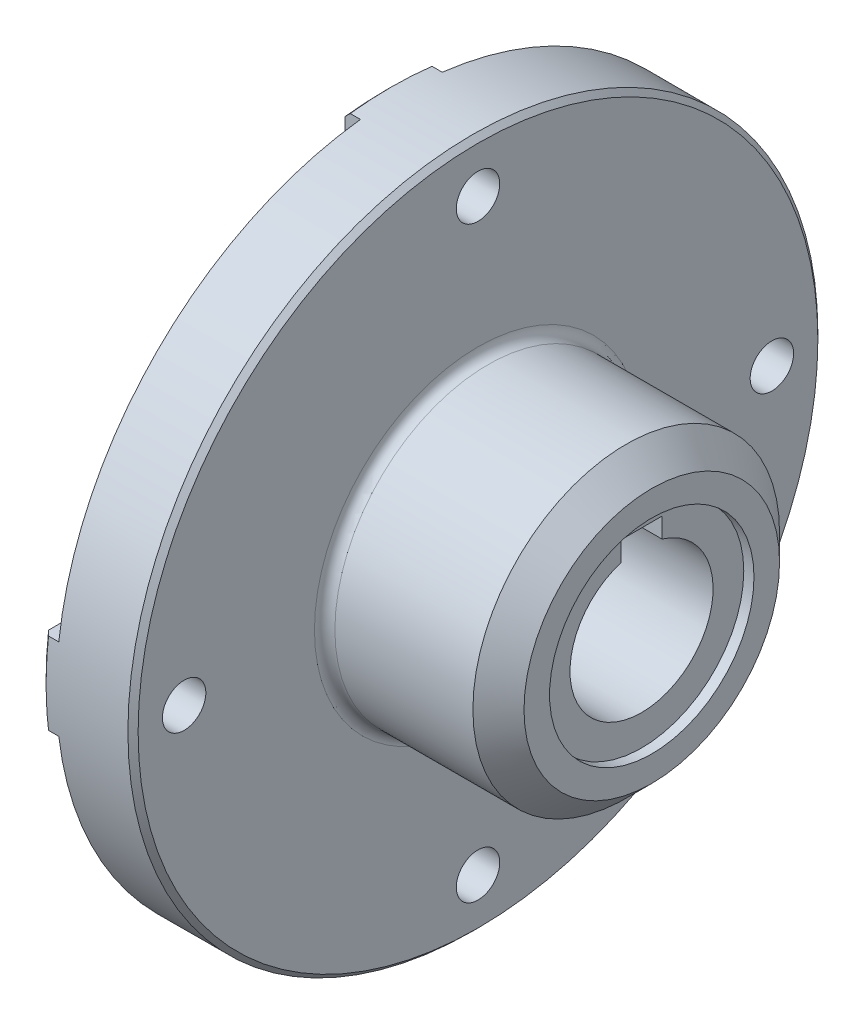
ISO-10303-21;
HEADER;
FILE_DESCRIPTION(('STEP AP214'),'2;1');
FILE_NAME('part.step','',(''),(''),'','','');
FILE_SCHEMA(('AUTOMOTIVE_DESIGN { 1 0 10303 214 1 1 1 1 }'));
ENDSEC;
DATA;
#1=APPLICATION_CONTEXT('core data for automotive mechanical design processes');
#2=APPLICATION_PROTOCOL_DEFINITION('international standard','automotive_design',2000,#1);
#3=PRODUCT_CONTEXT('',#1,'mechanical');
#4=PRODUCT('Part','Part','',(#3));
#5=PRODUCT_RELATED_PRODUCT_CATEGORY('part','',(#4));
#6=PRODUCT_DEFINITION_FORMATION('','',#4);
#7=PRODUCT_DEFINITION_CONTEXT('part definition',#1,'design');
#8=PRODUCT_DEFINITION('design','',#6,#7);
#9=PRODUCT_DEFINITION_SHAPE('','',#8);
#10=(LENGTH_UNIT() NAMED_UNIT(*) SI_UNIT(.MILLI.,.METRE.));
#11=(NAMED_UNIT(*) PLANE_ANGLE_UNIT() SI_UNIT($,.RADIAN.));
#12=(NAMED_UNIT(*) SI_UNIT($,.STERADIAN.) SOLID_ANGLE_UNIT());
#13=UNCERTAINTY_MEASURE_WITH_UNIT(LENGTH_MEASURE(1.E-05),#10,'distance_accuracy_value','');
#14=(GEOMETRIC_REPRESENTATION_CONTEXT(3) GLOBAL_UNCERTAINTY_ASSIGNED_CONTEXT((#13)) GLOBAL_UNIT_ASSIGNED_CONTEXT((#10,
#11,#12)) REPRESENTATION_CONTEXT('',''));
#15=CARTESIAN_POINT('',(0.,0.,0.));
#16=DIRECTION('',(0.,0.,1.));
#17=DIRECTION('',(1.,0.,0.));
#18=AXIS2_PLACEMENT_3D('',#15,#16,#17);
#19=CARTESIAN_POINT('',(-74.2496107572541,0.,0.));
#20=DIRECTION('',(-1.,0.,0.));
#21=DIRECTION('',(0.,0.,1.));
#22=AXIS2_PLACEMENT_3D('',#19,#20,#21);
#23=CYLINDRICAL_SURFACE('',#22,14.);
#24=CARTESIAN_POINT('',(-2.,0.,0.));
#25=DIRECTION('',(1.,0.,0.));
#26=DIRECTION('',(0.,0.,-1.));
#27=AXIS2_PLACEMENT_3D('',#24,#25,#26);
#28=CIRCLE('',#27,14.);
#29=CARTESIAN_POINT('',(-2.,13.4164078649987,-4.));
#30=VERTEX_POINT('',#29);
#31=CARTESIAN_POINT('',(-2.,13.4164078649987,4.));
#32=VERTEX_POINT('',#31);
#33=EDGE_CURVE('E218',#30,#32,#28,.F.);
#34=ORIENTED_EDGE('',*,*,#33,.F.);
#35=DIRECTION('',(-1.,0.,0.));
#36=VECTOR('',#35,1.);
#37=CARTESIAN_POINT('',(-74.2496107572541,13.4164078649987,-4.));
#38=LINE('',#37,#36);
#39=CARTESIAN_POINT('',(-38.,13.4164078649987,-4.));
#40=VERTEX_POINT('',#39);
#41=EDGE_CURVE('E227',#40,#30,#38,.F.);
#42=ORIENTED_EDGE('',*,*,#41,.F.);
#43=CARTESIAN_POINT('',(-38.,0.,0.));
#44=DIRECTION('',(1.,0.,0.));
#45=DIRECTION('',(0.,0.,-1.));
#46=AXIS2_PLACEMENT_3D('',#43,#44,#45);
#47=CIRCLE('',#46,14.);
#48=CARTESIAN_POINT('',(-38.,13.4164078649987,4.));
#49=VERTEX_POINT('',#48);
#50=EDGE_CURVE('E274',#40,#49,#47,.F.);
#51=ORIENTED_EDGE('',*,*,#50,.T.);
#52=DIRECTION('',(-1.,0.,0.));
#53=VECTOR('',#52,1.);
#54=CARTESIAN_POINT('',(-74.2496107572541,13.4164078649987,4.));
#55=LINE('',#54,#53);
#56=EDGE_CURVE('E229',#32,#49,#55,.T.);
#57=ORIENTED_EDGE('',*,*,#56,.F.);
#58=EDGE_LOOP('',(#34,#42,#51,#57));
#59=FACE_BOUND('',#58,.T.);
#60=ADVANCED_FACE('F28',(#59),#23,.F.);
#61=CARTESIAN_POINT('',(-52.,0.,4.));
#62=DIRECTION('',(0.,0.,-1.));
#63=DIRECTION('',(0.,1.,0.));
#64=AXIS2_PLACEMENT_3D('',#61,#62,#63);
#65=PLANE('',#64);
#66=DIRECTION('',(1.,0.,0.));
#67=VECTOR('',#66,1.);
#68=CARTESIAN_POINT('',(-52.,17.3,4.));
#69=LINE('',#68,#67);
#70=CARTESIAN_POINT('',(-39.,17.3,4.));
#71=VERTEX_POINT('',#70);
#72=CARTESIAN_POINT('',(-2.,17.3,4.));
#73=VERTEX_POINT('',#72);
#74=EDGE_CURVE('E237',#71,#73,#69,.T.);
#75=ORIENTED_EDGE('',*,*,#74,.T.);
#76=DIRECTION('',(0.,-1.,0.));
#77=VECTOR('',#76,1.);
#78=CARTESIAN_POINT('',(-2.,0.,4.));
#79=LINE('',#78,#77);
#80=EDGE_CURVE('E231',#73,#32,#79,.T.);
#81=ORIENTED_EDGE('',*,*,#80,.T.);
#82=ORIENTED_EDGE('',*,*,#56,.T.);
#83=CARTESIAN_POINT('',(-38.,13.4164078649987,4.));
#84=CARTESIAN_POINT('',(-38.1664202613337,13.5900487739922,4.));
#85=CARTESIAN_POINT('',(-38.3329637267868,13.7635712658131,4.));
#86=CARTESIAN_POINT('',(-38.6662970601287,14.1103794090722,4.));
#87=CARTESIAN_POINT('',(-38.833086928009,14.2836650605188,4.));
#88=CARTESIAN_POINT('',(-39.,14.456832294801,4.));
#89=B_SPLINE_CURVE_WITH_KNOTS('',3,(#83,#84,#85,#86,#87,#88),.UNSPECIFIED.,.F.,.F.,(4,2,4),(0.,
0.721540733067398,1.44308144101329),.UNSPECIFIED.);
#90=CARTESIAN_POINT('',(-39.,14.456832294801,4.));
#91=VERTEX_POINT('',#90);
#92=EDGE_CURVE('E276',#49,#91,#89,.T.);
#93=ORIENTED_EDGE('',*,*,#92,.T.);
#94=DIRECTION('',(0.,1.,0.));
#95=VECTOR('',#94,1.);
#96=CARTESIAN_POINT('',(-39.,47.5,4.));
#97=LINE('',#96,#95);
#98=EDGE_CURVE('E250',#91,#71,#97,.T.);
#99=ORIENTED_EDGE('',*,*,#98,.T.);
#100=EDGE_LOOP('',(#75,#81,#82,#93,#99));
#101=FACE_BOUND('',#100,.T.);
#102=ADVANCED_FACE('F285',(#101),#65,.T.);
#103=CARTESIAN_POINT('',(-52.,17.3,-4.));
#104=DIRECTION('',(0.,1.,0.));
#105=DIRECTION('',(0.,0.,1.));
#106=AXIS2_PLACEMENT_3D('',#103,#104,#105);
#107=PLANE('',#106);
#108=DIRECTION('',(0.,0.,-1.));
#109=VECTOR('',#108,1.);
#110=CARTESIAN_POINT('',(-2.,17.3,-4.));
#111=LINE('',#110,#109);
#112=CARTESIAN_POINT('',(-2.00000000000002,17.3,-4.));
#113=VERTEX_POINT('',#112);
#114=EDGE_CURVE('E43',#73,#113,#111,.T.);
#115=ORIENTED_EDGE('',*,*,#114,.F.);
#116=ORIENTED_EDGE('',*,*,#74,.F.);
#117=DIRECTION('',(0.,0.,1.));
#118=VECTOR('',#117,1.);
#119=CARTESIAN_POINT('',(-39.,17.3,0.));
#120=LINE('',#119,#118);
#121=CARTESIAN_POINT('',(-39.,17.3,-4.));
#122=VERTEX_POINT('',#121);
#123=EDGE_CURVE('E247',#122,#71,#120,.T.);
#124=ORIENTED_EDGE('',*,*,#123,.F.);
#125=DIRECTION('',(1.,0.,0.));
#126=VECTOR('',#125,1.);
#127=CARTESIAN_POINT('',(-52.,17.3,-4.));
#128=LINE('',#127,#126);
#129=EDGE_CURVE('E242',#122,#113,#128,.T.);
#130=ORIENTED_EDGE('',*,*,#129,.T.);
#131=EDGE_LOOP('',(#115,#116,#124,#130));
#132=FACE_BOUND('',#131,.T.);
#133=ADVANCED_FACE('F311',(#132),#107,.F.);
#134=CARTESIAN_POINT('',(-52.,17.3,-4.));
#135=DIRECTION('',(0.,0.,1.));
#136=DIRECTION('',(0.,-1.,0.));
#137=AXIS2_PLACEMENT_3D('',#134,#135,#136);
#138=PLANE('',#137);
#139=ORIENTED_EDGE('',*,*,#41,.T.);
#140=DIRECTION('',(0.,1.,0.));
#141=VECTOR('',#140,1.);
#142=CARTESIAN_POINT('',(-2.,17.3,-4.));
#143=LINE('',#142,#141);
#144=EDGE_CURVE('E11',#30,#113,#143,.T.);
#145=ORIENTED_EDGE('',*,*,#144,.T.);
#146=ORIENTED_EDGE('',*,*,#129,.F.);
#147=DIRECTION('',(0.,-1.,0.));
#148=VECTOR('',#147,1.);
#149=CARTESIAN_POINT('',(-39.,47.5,-4.00000000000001));
#150=LINE('',#149,#148);
#151=CARTESIAN_POINT('',(-39.,14.456832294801,-4.));
#152=VERTEX_POINT('',#151);
#153=EDGE_CURVE('E239',#122,#152,#150,.T.);
#154=ORIENTED_EDGE('',*,*,#153,.T.);
#155=CARTESIAN_POINT('',(-39.,14.456832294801,-4.));
#156=CARTESIAN_POINT('',(-38.833086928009,14.2836650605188,-4.));
#157=CARTESIAN_POINT('',(-38.6662970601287,14.1103794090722,-4.));
#158=CARTESIAN_POINT('',(-38.3329637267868,13.7635712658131,-4.));
#159=CARTESIAN_POINT('',(-38.1664202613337,13.5900487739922,-4.));
#160=CARTESIAN_POINT('',(-38.,13.4164078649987,-4.));
#161=B_SPLINE_CURVE_WITH_KNOTS('',3,(#155,#156,#157,#158,#159,#160),.UNSPECIFIED.,.F.,.F.,(4,2,
4),(0.,0.721540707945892,1.44308144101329),.UNSPECIFIED.);
#162=EDGE_CURVE('E236',#152,#40,#161,.T.);
#163=ORIENTED_EDGE('',*,*,#162,.T.);
#164=EDGE_LOOP('',(#139,#145,#146,#154,#163));
#165=FACE_BOUND('',#164,.T.);
#166=ADVANCED_FACE('F233',(#165),#138,.T.);
#167=CARTESIAN_POINT('',(-74.2496107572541,0.,0.));
#168=DIRECTION('',(-1.,0.,0.));
#169=DIRECTION('',(0.,0.,1.));
#170=AXIS2_PLACEMENT_3D('',#167,#168,#169);
#171=CYLINDRICAL_SURFACE('',#170,47.5);
#172=CARTESIAN_POINT('',(-41.,0.,0.));
#173=DIRECTION('',(1.,0.,0.));
#174=DIRECTION('',(0.,0.,-1.));
#175=AXIS2_PLACEMENT_3D('',#172,#173,#174);
#176=CIRCLE('',#175,47.5);
#177=CARTESIAN_POINT('',(-41.,0.,-47.5));
#178=VERTEX_POINT('',#177);
#179=EDGE_CURVE('E370',#178,#178,#176,.T.);
#180=ORIENTED_EDGE('',*,*,#179,.T.);
#181=EDGE_LOOP('',(#180));
#182=FACE_BOUND('',#181,.T.);
#183=DIRECTION('',(-1.,0.,0.));
#184=VECTOR('',#183,1.);
#185=CARTESIAN_POINT('',(-74.2496107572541,-46.8214694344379,8.));
#186=LINE('',#185,#184);
#187=CARTESIAN_POINT('',(-49.,-46.8214694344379,8.));
#188=VERTEX_POINT('',#187);
#189=CARTESIAN_POINT('',(-51.,-46.8214694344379,8.));
#190=VERTEX_POINT('',#189);
#191=EDGE_CURVE('E931',#188,#190,#186,.T.);
#192=ORIENTED_EDGE('',*,*,#191,.F.);
#193=CARTESIAN_POINT('',(-49.,0.,0.));
#194=DIRECTION('',(1.,0.,0.));
#195=DIRECTION('',(0.,0.,-1.));
#196=AXIS2_PLACEMENT_3D('',#193,#194,#195);
#197=CIRCLE('',#196,47.5);
#198=CARTESIAN_POINT('',(-49.,-8.00000000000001,46.8214694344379));
#199=VERTEX_POINT('',#198);
#200=EDGE_CURVE('E929',#188,#199,#197,.F.);
#201=ORIENTED_EDGE('',*,*,#200,.T.);
#202=DIRECTION('',(-1.,0.,0.));
#203=VECTOR('',#202,1.);
#204=CARTESIAN_POINT('',(-74.2496107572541,-8.00000000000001,46.8214694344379));
#205=LINE('',#204,#203);
#206=CARTESIAN_POINT('',(-51.,-8.00000000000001,46.8214694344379));
#207=VERTEX_POINT('',#206);
#208=EDGE_CURVE('E479',#199,#207,#205,.T.);
#209=ORIENTED_EDGE('',*,*,#208,.T.);
#210=CARTESIAN_POINT('',(-51.,0.,0.));
#211=DIRECTION('',(1.,0.,0.));
#212=DIRECTION('',(0.,0.,-1.));
#213=AXIS2_PLACEMENT_3D('',#210,#211,#212);
#214=CIRCLE('',#213,47.5);
#215=CARTESIAN_POINT('',(-51.,8.00000000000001,46.8214694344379));
#216=VERTEX_POINT('',#215);
#217=EDGE_CURVE('E820',#207,#216,#214,.F.);
#218=ORIENTED_EDGE('',*,*,#217,.T.);
#219=DIRECTION('',(-1.,0.,0.));
#220=VECTOR('',#219,1.);
#221=CARTESIAN_POINT('',(-74.2496107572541,8.00000000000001,46.8214694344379));
#222=LINE('',#221,#220);
#223=CARTESIAN_POINT('',(-49.,8.00000000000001,46.8214694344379));
#224=VERTEX_POINT('',#223);
#225=EDGE_CURVE('E415',#224,#216,#222,.T.);
#226=ORIENTED_EDGE('',*,*,#225,.F.);
#227=CARTESIAN_POINT('',(-49.,0.,0.));
#228=DIRECTION('',(1.,0.,0.));
#229=DIRECTION('',(0.,0.,-1.));
#230=AXIS2_PLACEMENT_3D('',#227,#228,#229);
#231=CIRCLE('',#230,47.5);
#232=CARTESIAN_POINT('',(-49.,46.8214694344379,8.));
#233=VERTEX_POINT('',#232);
#234=EDGE_CURVE('E797',#224,#233,#231,.F.);
#235=ORIENTED_EDGE('',*,*,#234,.T.);
#236=DIRECTION('',(-1.,0.,0.));
#237=VECTOR('',#236,1.);
#238=CARTESIAN_POINT('',(-74.2496107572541,46.8214694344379,8.));
#239=LINE('',#238,#237);
#240=CARTESIAN_POINT('',(-51.,46.8214694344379,8.));
#241=VERTEX_POINT('',#240);
#242=EDGE_CURVE('E799',#233,#241,#239,.T.);
#243=ORIENTED_EDGE('',*,*,#242,.T.);
#244=CARTESIAN_POINT('',(-51.,46.8214694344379,-8.));
#245=VERTEX_POINT('',#244);
#246=EDGE_CURVE('E839',#241,#245,#214,.F.);
#247=ORIENTED_EDGE('',*,*,#246,.T.);
#248=DIRECTION('',(-1.,0.,0.));
#249=VECTOR('',#248,1.);
#250=CARTESIAN_POINT('',(-74.2496107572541,46.8214694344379,-8.));
#251=LINE('',#250,#249);
#252=CARTESIAN_POINT('',(-49.,46.8214694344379,-8.));
#253=VERTEX_POINT('',#252);
#254=EDGE_CURVE('E961',#253,#245,#251,.T.);
#255=ORIENTED_EDGE('',*,*,#254,.F.);
#256=CARTESIAN_POINT('',(-49.,0.,0.));
#257=DIRECTION('',(1.,0.,0.));
#258=DIRECTION('',(0.,0.,-1.));
#259=AXIS2_PLACEMENT_3D('',#256,#257,#258);
#260=CIRCLE('',#259,47.5);
#261=CARTESIAN_POINT('',(-49.,8.00000000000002,-46.8214694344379));
#262=VERTEX_POINT('',#261);
#263=EDGE_CURVE('E958',#253,#262,#260,.F.);
#264=ORIENTED_EDGE('',*,*,#263,.T.);
#265=DIRECTION('',(-1.,0.,0.));
#266=VECTOR('',#265,1.);
#267=CARTESIAN_POINT('',(-74.2496107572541,8.00000000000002,-46.8214694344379));
#268=LINE('',#267,#266);
#269=CARTESIAN_POINT('',(-51.,8.00000000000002,-46.8214694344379));
#270=VERTEX_POINT('',#269);
#271=EDGE_CURVE('E960',#262,#270,#268,.T.);
#272=ORIENTED_EDGE('',*,*,#271,.T.);
#273=CARTESIAN_POINT('',(-51.,-8.,-46.8214694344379));
#274=VERTEX_POINT('',#273);
#275=EDGE_CURVE('E842',#270,#274,#214,.F.);
#276=ORIENTED_EDGE('',*,*,#275,.T.);
#277=DIRECTION('',(-1.,0.,0.));
#278=VECTOR('',#277,1.);
#279=CARTESIAN_POINT('',(-74.2496107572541,-8.,-46.8214694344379));
#280=LINE('',#279,#278);
#281=CARTESIAN_POINT('',(-49.,-8.,-46.8214694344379));
#282=VERTEX_POINT('',#281);
#283=EDGE_CURVE('E944',#282,#274,#280,.T.);
#284=ORIENTED_EDGE('',*,*,#283,.F.);
#285=CARTESIAN_POINT('',(-49.,0.,0.));
#286=DIRECTION('',(-1.,0.,0.));
#287=DIRECTION('',(0.,0.,1.));
#288=AXIS2_PLACEMENT_3D('',#285,#286,#287);
#289=CIRCLE('',#288,47.5);
#290=CARTESIAN_POINT('',(-49.,-46.8214694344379,-8.00000000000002));
#291=VERTEX_POINT('',#290);
#292=EDGE_CURVE('E942',#291,#282,#289,.F.);
#293=ORIENTED_EDGE('',*,*,#292,.F.);
#294=DIRECTION('',(-1.,0.,0.));
#295=VECTOR('',#294,1.);
#296=CARTESIAN_POINT('',(-74.2496107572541,-46.8214694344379,-8.00000000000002));
#297=LINE('',#296,#295);
#298=CARTESIAN_POINT('',(-51.,-46.8214694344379,-8.00000000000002));
#299=VERTEX_POINT('',#298);
#300=EDGE_CURVE('E919',#291,#299,#297,.T.);
#301=ORIENTED_EDGE('',*,*,#300,.T.);
#302=EDGE_CURVE('E845',#299,#190,#214,.F.);
#303=ORIENTED_EDGE('',*,*,#302,.T.);
#304=EDGE_LOOP('',(#192,#201,#209,#218,#226,#235,#243,#247,#255,#264,#272,#276,#284,#293,#301,#303));
#305=FACE_BOUND('',#304,.T.);
#306=ADVANCED_FACE('F310',(#182,#305),#171,.F.);
#307=CARTESIAN_POINT('',(-74.2496107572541,0.,0.));
#308=DIRECTION('',(-1.,0.,0.));
#309=DIRECTION('',(0.,0.,1.));
#310=AXIS2_PLACEMENT_3D('',#307,#308,#309);
#311=CYLINDRICAL_SURFACE('',#310,67.5);
#312=CARTESIAN_POINT('',(-35.,0.,0.));
#313=DIRECTION('',(-1.,0.,0.));
#314=DIRECTION('',(0.,0.,1.));
#315=AXIS2_PLACEMENT_3D('',#312,#313,#314);
#316=CIRCLE('',#315,67.5);
#317=CARTESIAN_POINT('',(-35.,0.,67.5));
#318=VERTEX_POINT('',#317);
#319=EDGE_CURVE('E850',#318,#318,#316,.T.);
#320=ORIENTED_EDGE('',*,*,#319,.T.);
#321=EDGE_LOOP('',(#320));
#322=FACE_BOUND('',#321,.T.);
#323=DIRECTION('',(-1.,0.,0.));
#324=VECTOR('',#323,1.);
#325=CARTESIAN_POINT('',(-74.2496107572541,-67.0242493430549,8.));
#326=LINE('',#325,#324);
#327=CARTESIAN_POINT('',(-51.,-67.0242493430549,8.));
#328=VERTEX_POINT('',#327);
#329=CARTESIAN_POINT('',(-49.,-67.0242493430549,8.));
#330=VERTEX_POINT('',#329);
#331=EDGE_CURVE('E510',#328,#330,#326,.F.);
#332=ORIENTED_EDGE('',*,*,#331,.F.);
#333=CARTESIAN_POINT('',(-51.,0.,0.));
#334=DIRECTION('',(1.,0.,0.));
#335=DIRECTION('',(0.,0.,-1.));
#336=AXIS2_PLACEMENT_3D('',#333,#334,#335);
#337=CIRCLE('',#336,67.5);
#338=CARTESIAN_POINT('',(-51.,-67.0242493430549,-8.00000000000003));
#339=VERTEX_POINT('',#338);
#340=EDGE_CURVE('E855',#328,#339,#337,.T.);
#341=ORIENTED_EDGE('',*,*,#340,.T.);
#342=DIRECTION('',(-1.,0.,0.));
#343=VECTOR('',#342,1.);
#344=CARTESIAN_POINT('',(-74.2496107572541,-67.0242493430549,-8.00000000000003));
#345=LINE('',#344,#343);
#346=CARTESIAN_POINT('',(-49.,-67.0242493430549,-8.00000000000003));
#347=VERTEX_POINT('',#346);
#348=EDGE_CURVE('E916',#339,#347,#345,.F.);
#349=ORIENTED_EDGE('',*,*,#348,.T.);
#350=CARTESIAN_POINT('',(-49.,0.,0.));
#351=DIRECTION('',(-1.,0.,0.));
#352=DIRECTION('',(0.,0.,1.));
#353=AXIS2_PLACEMENT_3D('',#350,#351,#352);
#354=CIRCLE('',#353,67.5);
#355=CARTESIAN_POINT('',(-49.,-7.99999999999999,-67.0242493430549));
#356=VERTEX_POINT('',#355);
#357=EDGE_CURVE('E501',#356,#347,#354,.T.);
#358=ORIENTED_EDGE('',*,*,#357,.F.);
#359=DIRECTION('',(-1.,0.,0.));
#360=VECTOR('',#359,1.);
#361=CARTESIAN_POINT('',(-74.2496107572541,-7.99999999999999,-67.0242493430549));
#362=LINE('',#361,#360);
#363=CARTESIAN_POINT('',(-51.,-7.99999999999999,-67.0242493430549));
#364=VERTEX_POINT('',#363);
#365=EDGE_CURVE('E868',#364,#356,#362,.F.);
#366=ORIENTED_EDGE('',*,*,#365,.F.);
#367=CARTESIAN_POINT('',(-51.,8.00000000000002,-67.0242493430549));
#368=VERTEX_POINT('',#367);
#369=EDGE_CURVE('E858',#364,#368,#337,.T.);
#370=ORIENTED_EDGE('',*,*,#369,.T.);
#371=DIRECTION('',(-1.,0.,0.));
#372=VECTOR('',#371,1.);
#373=CARTESIAN_POINT('',(-74.2496107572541,8.00000000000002,-67.0242493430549));
#374=LINE('',#373,#372);
#375=CARTESIAN_POINT('',(-49.,8.00000000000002,-67.0242493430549));
#376=VERTEX_POINT('',#375);
#377=EDGE_CURVE('E866',#368,#376,#374,.F.);
#378=ORIENTED_EDGE('',*,*,#377,.T.);
#379=CARTESIAN_POINT('',(-49.,0.,0.));
#380=DIRECTION('',(1.,0.,0.));
#381=DIRECTION('',(0.,0.,-1.));
#382=AXIS2_PLACEMENT_3D('',#379,#380,#381);
#383=CIRCLE('',#382,67.5);
#384=CARTESIAN_POINT('',(-49.,67.0242493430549,-8.));
#385=VERTEX_POINT('',#384);
#386=EDGE_CURVE('E882',#376,#385,#383,.T.);
#387=ORIENTED_EDGE('',*,*,#386,.T.);
#388=DIRECTION('',(-1.,0.,0.));
#389=VECTOR('',#388,1.);
#390=CARTESIAN_POINT('',(-74.2496107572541,67.0242493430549,-8.));
#391=LINE('',#390,#389);
#392=CARTESIAN_POINT('',(-51.,67.0242493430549,-8.));
#393=VERTEX_POINT('',#392);
#394=EDGE_CURVE('E972',#393,#385,#391,.F.);
#395=ORIENTED_EDGE('',*,*,#394,.F.);
#396=CARTESIAN_POINT('',(-51.,67.0242493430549,8.));
#397=VERTEX_POINT('',#396);
#398=EDGE_CURVE('E304',#393,#397,#337,.T.);
#399=ORIENTED_EDGE('',*,*,#398,.T.);
#400=DIRECTION('',(-1.,0.,0.));
#401=VECTOR('',#400,1.);
#402=CARTESIAN_POINT('',(-74.2496107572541,67.0242493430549,8.));
#403=LINE('',#402,#401);
#404=CARTESIAN_POINT('',(-49.,67.0242493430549,8.));
#405=VERTEX_POINT('',#404);
#406=EDGE_CURVE('E804',#397,#405,#403,.F.);
#407=ORIENTED_EDGE('',*,*,#406,.T.);
#408=CARTESIAN_POINT('',(-49.,0.,0.));
#409=DIRECTION('',(1.,0.,0.));
#410=DIRECTION('',(0.,0.,-1.));
#411=AXIS2_PLACEMENT_3D('',#408,#409,#410);
#412=CIRCLE('',#411,67.5);
#413=CARTESIAN_POINT('',(-49.,8.00000000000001,67.0242493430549));
#414=VERTEX_POINT('',#413);
#415=EDGE_CURVE('E879',#405,#414,#412,.T.);
#416=ORIENTED_EDGE('',*,*,#415,.T.);
#417=DIRECTION('',(-1.,0.,0.));
#418=VECTOR('',#417,1.);
#419=CARTESIAN_POINT('',(-74.2496107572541,8.00000000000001,67.0242493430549));
#420=LINE('',#419,#418);
#421=CARTESIAN_POINT('',(-51.,8.,67.0242493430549));
#422=VERTEX_POINT('',#421);
#423=EDGE_CURVE('E416',#422,#414,#420,.F.);
#424=ORIENTED_EDGE('',*,*,#423,.F.);
#425=CARTESIAN_POINT('',(-51.,-8.00000000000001,67.0242493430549));
#426=VERTEX_POINT('',#425);
#427=EDGE_CURVE('E305',#422,#426,#337,.T.);
#428=ORIENTED_EDGE('',*,*,#427,.T.);
#429=DIRECTION('',(-1.,0.,0.));
#430=VECTOR('',#429,1.);
#431=CARTESIAN_POINT('',(-74.2496107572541,-8.00000000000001,67.0242493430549));
#432=LINE('',#431,#430);
#433=CARTESIAN_POINT('',(-49.,-8.00000000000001,67.0242493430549));
#434=VERTEX_POINT('',#433);
#435=EDGE_CURVE('E50',#426,#434,#432,.F.);
#436=ORIENTED_EDGE('',*,*,#435,.T.);
#437=CARTESIAN_POINT('',(-49.,0.,0.));
#438=DIRECTION('',(1.,0.,0.));
#439=DIRECTION('',(0.,0.,-1.));
#440=AXIS2_PLACEMENT_3D('',#437,#438,#439);
#441=CIRCLE('',#440,67.5);
#442=EDGE_CURVE('E36',#434,#330,#441,.T.);
#443=ORIENTED_EDGE('',*,*,#442,.T.);
#444=EDGE_LOOP('',(#332,#341,#349,#358,#366,#370,#378,#387,#395,#399,#407,#416,#424,#428,#436,#443));
#445=FACE_BOUND('',#444,.T.);
#446=ADVANCED_FACE('F321',(#322,#445),#311,.T.);
#447=CARTESIAN_POINT('',(-52.,67.5,0.));
#448=DIRECTION('',(1.,0.,0.));
#449=DIRECTION('',(0.,0.,-1.));
#450=AXIS2_PLACEMENT_3D('',#447,#448,#449);
#451=PLANE('',#450);
#452=CARTESIAN_POINT('',(-52.,-57.5,0.));
#453=DIRECTION('',(1.,0.,0.));
#454=DIRECTION('',(0.,0.,-1.));
#455=AXIS2_PLACEMENT_3D('',#452,#453,#454);
#456=CIRCLE('',#455,4.25);
#457=CARTESIAN_POINT('',(-52.,-57.5,4.25));
#458=VERTEX_POINT('',#457);
#459=EDGE_CURVE('E268',#458,#458,#456,.T.);
#460=ORIENTED_EDGE('',*,*,#459,.T.);
#461=EDGE_LOOP('',(#460));
#462=FACE_BOUND('',#461,.T.);
#463=DIRECTION('',(0.,1.,0.));
#464=VECTOR('',#463,1.);
#465=CARTESIAN_POINT('',(-52.,-103.,8.));
#466=LINE('',#465,#464);
#467=CARTESIAN_POINT('',(-52.,-66.0170432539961,8.));
#468=VERTEX_POINT('',#467);
#469=CARTESIAN_POINT('',(-52.,-47.8356561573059,8.));
#470=VERTEX_POINT('',#469);
#471=EDGE_CURVE('E230',#468,#470,#466,.T.);
#472=ORIENTED_EDGE('',*,*,#471,.T.);
#473=CARTESIAN_POINT('',(-52.,0.,0.));
#474=DIRECTION('',(1.,0.,0.));
#475=DIRECTION('',(0.,0.,-1.));
#476=AXIS2_PLACEMENT_3D('',#473,#474,#475);
#477=CIRCLE('',#476,48.5);
#478=CARTESIAN_POINT('',(-52.,-47.8356561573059,-8.00000000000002));
#479=VERTEX_POINT('',#478);
#480=EDGE_CURVE('E823',#470,#479,#477,.T.);
#481=ORIENTED_EDGE('',*,*,#480,.T.);
#482=DIRECTION('',(0.,1.,0.));
#483=VECTOR('',#482,1.);
#484=CARTESIAN_POINT('',(-52.,-103.,-8.00000000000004));
#485=LINE('',#484,#483);
#486=CARTESIAN_POINT('',(-52.,-66.0170432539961,-8.00000000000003));
#487=VERTEX_POINT('',#486);
#488=EDGE_CURVE('E923',#487,#479,#485,.T.);
#489=ORIENTED_EDGE('',*,*,#488,.F.);
#490=CARTESIAN_POINT('',(-52.,0.,0.));
#491=DIRECTION('',(1.,0.,0.));
#492=DIRECTION('',(0.,0.,-1.));
#493=AXIS2_PLACEMENT_3D('',#490,#491,#492);
#494=CIRCLE('',#493,66.5);
#495=EDGE_CURVE('E837',#487,#468,#494,.F.);
#496=ORIENTED_EDGE('',*,*,#495,.T.);
#497=EDGE_LOOP('',(#472,#481,#489,#496));
#498=FACE_BOUND('',#497,.T.);
#499=ADVANCED_FACE('F324',(#462,#498),#451,.F.);
#500=CARTESIAN_POINT('',(-51.,0.,0.));
#501=DIRECTION('',(-1.,0.,0.));
#502=DIRECTION('',(0.,0.,1.));
#503=AXIS2_PLACEMENT_3D('',#500,#501,#502);
#504=CONICAL_SURFACE('',#503,47.5,0.785398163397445);
#505=ORIENTED_EDGE('',*,*,#480,.F.);
#506=CARTESIAN_POINT('',(-79.5641411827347,-75.6422737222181,8.));
#507=CARTESIAN_POINT('',(-78.3112914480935,-74.382433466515,8.));
#508=CARTESIAN_POINT('',(-77.0586123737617,-73.1224234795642,8.));
#509=CARTESIAN_POINT('',(-74.5536611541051,-70.6019991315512,8.));
#510=CARTESIAN_POINT('',(-73.3013890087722,-69.3415847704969,8.));
#511=CARTESIAN_POINT('',(-69.5453253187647,-65.5596820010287,8.));
#512=CARTESIAN_POINT('',(-67.0422424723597,-63.0374896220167,8.));
#513=CARTESIAN_POINT('',(-62.0389426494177,-57.9906714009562,8.));
#514=CARTESIAN_POINT('',(-59.5387254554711,-55.4660457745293,8.));
#515=CARTESIAN_POINT('',(-55.7913677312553,-51.6761291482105,8.));
#516=CARTESIAN_POINT('',(-54.5427323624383,-50.4123162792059,8.));
#517=CARTESIAN_POINT('',(-52.0467145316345,-47.8834513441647,8.));
#518=CARTESIAN_POINT('',(-50.79933207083,-46.6183992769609,8.));
#519=CARTESIAN_POINT('',(-48.3059710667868,-44.0865447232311,8.));
#520=CARTESIAN_POINT('',(-47.0599927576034,-42.8197420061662,7.99999999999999));
#521=CARTESIAN_POINT('',(-44.5700964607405,-40.2841207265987,7.99999999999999));
#522=CARTESIAN_POINT('',(-43.32617846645,-39.01530217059,7.99999999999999));
#523=CARTESIAN_POINT('',(-40.8411290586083,-36.4750505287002,7.99999999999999));
#524=CARTESIAN_POINT('',(-39.5999975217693,-35.2036175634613,7.99999999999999));
#525=CARTESIAN_POINT('',(-37.1214391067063,-32.6571128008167,7.99999999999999));
#526=CARTESIAN_POINT('',(-35.8840122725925,-31.3820409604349,7.99999999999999));
#527=CARTESIAN_POINT('',(-34.0317551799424,-29.4654837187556,7.99999999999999));
#528=CARTESIAN_POINT('',(-33.414934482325,-28.8259220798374,7.99999999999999));
#529=CARTESIAN_POINT('',(-32.1829145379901,-27.5452399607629,7.99999999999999));
#530=CARTESIAN_POINT('',(-31.5677152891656,-26.9041194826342,7.99999999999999));
#531=CARTESIAN_POINT('',(-30.3393242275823,-25.6199986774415,7.99999999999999));
#532=CARTESIAN_POINT('',(-29.7261323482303,-24.9769984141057,7.99999999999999));
#533=CARTESIAN_POINT('',(-28.5022225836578,-23.6886398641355,7.99999999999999));
#534=CARTESIAN_POINT('',(-27.8915047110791,-23.0432815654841,7.99999999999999));
#535=CARTESIAN_POINT('',(-26.6731112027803,-21.7494933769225,7.99999999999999));
#536=CARTESIAN_POINT('',(-26.0654360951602,-21.1010629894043,7.99999999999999));
#537=CARTESIAN_POINT('',(-24.8541619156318,-19.800417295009,7.99999999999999));
#538=CARTESIAN_POINT('',(-24.2505627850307,-19.1482020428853,7.99999999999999));
#539=CARTESIAN_POINT('',(-23.349197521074,-18.1661067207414,7.99999999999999));
#540=CARTESIAN_POINT('',(-23.0493971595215,-17.8380934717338,7.99999999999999));
#541=CARTESIAN_POINT('',(-22.4513872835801,-17.1806215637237,7.99999999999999));
#542=CARTESIAN_POINT('',(-22.1531777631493,-16.8511629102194,7.99999999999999));
#543=CARTESIAN_POINT('',(-21.5586052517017,-16.1905533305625,7.99999999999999));
#544=CARTESIAN_POINT('',(-21.2622423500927,-15.8594023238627,7.99999999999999));
#545=CARTESIAN_POINT('',(-20.6717402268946,-15.1951164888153,7.99999999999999));
#546=CARTESIAN_POINT('',(-20.3776010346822,-14.8619816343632,7.99999999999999));
#547=CARTESIAN_POINT('',(-20.0847589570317,-14.527705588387,7.99999999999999));
#548=B_SPLINE_CURVE_WITH_KNOTS('',3,(#506,#507,#508,#509,#510,#511,#512,#513,#514,#515,#516,
#517,#518,#519,#520,#521,#522,#523,#524,#525,#526,#527,#528,#529,#530,#531,#532,#533,#534,#535,
#536,#537,#538,#539,#540,#541,#542,#543,#544,#545,#546,#547),.UNSPECIFIED.,.F.,.F.,(4,2,2,2,2,2,
2,2,2,2,2,2,2,2,2,2,2,2,2,2,4),(0.,5.33024101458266,10.6604819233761,21.3207763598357,
31.9801999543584,37.310004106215,42.6398132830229,47.9704081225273,53.3009858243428,
58.6313228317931,63.9617230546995,66.6273468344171,69.2929671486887,71.9584981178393,
74.6240426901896,77.2900348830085,79.9559886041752,81.2891222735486,82.6222508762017,
83.9554435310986,85.2886537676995),.UNSPECIFIED.);
#549=EDGE_CURVE('E932',#470,#190,#548,.T.);
#550=ORIENTED_EDGE('',*,*,#549,.T.);
#551=ORIENTED_EDGE('',*,*,#302,.F.);
#552=CARTESIAN_POINT('',(-79.5641411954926,-75.6422737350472,-8.00000000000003));
#553=CARTESIAN_POINT('',(-78.3112914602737,-74.3824334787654,-8.00000000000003));
#554=CARTESIAN_POINT('',(-77.0586123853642,-73.1224234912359,-8.00000000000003));
#555=CARTESIAN_POINT('',(-74.5536611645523,-70.6019991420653,-8.00000000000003));
#556=CARTESIAN_POINT('',(-73.3013890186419,-69.3415847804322,-8.00000000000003));
#557=CARTESIAN_POINT('',(-69.5453253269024,-65.5596820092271,-8.00000000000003));
#558=CARTESIAN_POINT('',(-67.0422424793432,-63.0374896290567,-8.00000000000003));
#559=CARTESIAN_POINT('',(-62.0389426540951,-57.9906714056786,-8.00000000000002));
#560=CARTESIAN_POINT('',(-59.5387254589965,-55.4660457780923,-8.00000000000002));
#561=CARTESIAN_POINT('',(-55.791367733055,-51.6761291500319,-8.00000000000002));
#562=CARTESIAN_POINT('',(-54.5427323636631,-50.4123162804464,-8.00000000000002));
#563=CARTESIAN_POINT('',(-52.0467145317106,-47.8834513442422,-8.00000000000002));
#564=CARTESIAN_POINT('',(-50.7993320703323,-46.6183992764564,-8.00000000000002));
#565=CARTESIAN_POINT('',(-48.305971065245,-44.0865447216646,-8.00000000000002));
#566=CARTESIAN_POINT('',(-47.0599927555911,-42.8197420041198,-8.00000000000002));
#567=CARTESIAN_POINT('',(-44.5700964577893,-40.2841207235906,-8.00000000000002));
#568=CARTESIAN_POINT('',(-43.3261784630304,-39.0153021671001,-8.00000000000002));
#569=CARTESIAN_POINT('',(-40.8411290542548,-36.4750505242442,-8.00000000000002));
#570=CARTESIAN_POINT('',(-39.5999975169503,-35.2036175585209,-8.00000000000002));
#571=CARTESIAN_POINT('',(-37.1214391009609,-32.6571127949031,-8.00000000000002));
#572=CARTESIAN_POINT('',(-35.8840122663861,-31.3820409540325,-8.00000000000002));
#573=CARTESIAN_POINT('',(-34.0317551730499,-29.4654837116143,-8.00000000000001));
#574=CARTESIAN_POINT('',(-33.4149344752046,-28.8259220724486,-8.00000000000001));
#575=CARTESIAN_POINT('',(-32.1829145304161,-27.5452399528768,-8.00000000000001));
#576=CARTESIAN_POINT('',(-31.5677152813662,-26.9041194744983,-8.00000000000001));
#577=CARTESIAN_POINT('',(-30.3393242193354,-25.619998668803,-8.00000000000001));
#578=CARTESIAN_POINT('',(-29.7261323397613,-24.9769984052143,-8.00000000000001));
#579=CARTESIAN_POINT('',(-28.5022225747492,-23.6886398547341,-8.00000000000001));
#580=CARTESIAN_POINT('',(-27.8915047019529,-23.0432815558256,-8.00000000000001));
#581=CARTESIAN_POINT('',(-26.673111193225,-21.7494933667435,-8.00000000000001));
#582=CARTESIAN_POINT('',(-26.0654360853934,-21.1010629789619,-8.00000000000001));
#583=CARTESIAN_POINT('',(-24.8541619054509,-19.8004172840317,-8.00000000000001));
#584=CARTESIAN_POINT('',(-24.2505627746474,-19.1482020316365,-8.00000000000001));
#585=CARTESIAN_POINT('',(-23.349197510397,-18.1661067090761,-8.00000000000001));
#586=CARTESIAN_POINT('',(-23.0493971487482,-17.8380934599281,-8.00000000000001));
#587=CARTESIAN_POINT('',(-22.4513872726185,-17.1806215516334,-8.00000000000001));
#588=CARTESIAN_POINT('',(-22.1531777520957,-16.8511628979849,-8.00000000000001));
#589=CARTESIAN_POINT('',(-21.5586052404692,-16.1905533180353,-8.00000000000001));
#590=CARTESIAN_POINT('',(-21.2622423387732,-15.8594023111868,-8.00000000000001));
#591=CARTESIAN_POINT('',(-20.6717402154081,-15.1951164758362,-8.00000000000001));
#592=CARTESIAN_POINT('',(-20.3776010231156,-14.8619816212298,-8.00000000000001));
#593=CARTESIAN_POINT('',(-20.084758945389,-14.5277055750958,-8.00000000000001));
#594=B_SPLINE_CURVE_WITH_KNOTS('',3,(#552,#553,#554,#555,#556,#557,#558,#559,#560,#561,#562,
#563,#564,#565,#566,#567,#568,#569,#570,#571,#572,#573,#574,#575,#576,#577,#578,#579,#580,#581,
#582,#583,#584,#585,#586,#587,#588,#589,#590,#591,#592,#593),.UNSPECIFIED.,.F.,.F.,(4,2,2,2,2,2,
2,2,2,2,2,2,2,2,2,2,2,2,2,2,4),(0.,5.33024101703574,10.6604819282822,21.3207763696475,
31.9801999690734,37.3100041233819,42.6398133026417,47.9704081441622,53.3009858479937,
58.6313228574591,63.9617230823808,66.6273468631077,69.2929671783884,71.9584981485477,
74.6240427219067,77.2900349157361,79.9559886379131,81.2891223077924,82.6222509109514,
83.9554435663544,85.2886538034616),.UNSPECIFIED.);
#595=EDGE_CURVE('E456',#479,#299,#594,.T.);
#596=ORIENTED_EDGE('',*,*,#595,.F.);
#597=EDGE_LOOP('',(#505,#550,#551,#596));
#598=FACE_BOUND('',#597,.T.);
#599=ADVANCED_FACE('F423',(#598),#504,.F.);
#600=CARTESIAN_POINT('',(-52.,0.,0.));
#601=DIRECTION('',(1.,0.,0.));
#602=DIRECTION('',(0.,0.,-1.));
#603=AXIS2_PLACEMENT_3D('',#600,#601,#602);
#604=CONICAL_SURFACE('',#603,66.5,0.785398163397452);
#605=ORIENTED_EDGE('',*,*,#340,.F.);
#606=CARTESIAN_POINT('',(-11.2180491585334,-106.983255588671,8.));
#607=CARTESIAN_POINT('',(-13.0328604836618,-105.163374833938,8.));
#608=CARTESIAN_POINT('',(-14.8475453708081,-103.343367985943,8.));
#609=CARTESIAN_POINT('',(-18.476612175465,-99.7030523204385,8.));
#610=CARTESIAN_POINT('',(-20.2909940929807,-97.8827435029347,8.));
#611=CARTESIAN_POINT('',(-25.733587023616,-92.4213127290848,8.));
#612=CARTESIAN_POINT('',(-29.361268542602,-88.7796630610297,8.));
#613=CARTESIAN_POINT('',(-36.6145271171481,-81.4944643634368,8.));
#614=CARTESIAN_POINT('',(-40.2401042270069,-77.8509153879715,8.));
#615=CARTESIAN_POINT('',(-45.6761985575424,-72.3833110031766,8.));
#616=CARTESIAN_POINT('',(-47.4878570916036,-70.5603903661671,8.));
#617=CARTESIAN_POINT('',(-51.1102095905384,-66.9135895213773,8.));
#618=CARTESIAN_POINT('',(-52.9209035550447,-65.0897093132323,8.));
#619=CARTESIAN_POINT('',(-56.5411498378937,-61.440634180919,8.));
#620=CARTESIAN_POINT('',(-58.3507020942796,-59.6154391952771,8.));
#621=CARTESIAN_POINT('',(-61.9681916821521,-55.9634539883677,8.));
#622=CARTESIAN_POINT('',(-63.7761290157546,-54.1366637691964,8.));
#623=CARTESIAN_POINT('',(-67.3898056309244,-50.4809704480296,8.));
#624=CARTESIAN_POINT('',(-69.1955449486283,-48.6520673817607,8.));
#625=CARTESIAN_POINT('',(-72.8040356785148,-44.9912969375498,8.));
#626=CARTESIAN_POINT('',(-74.606787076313,-43.1594295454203,7.99999999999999));
#627=CARTESIAN_POINT('',(-77.3076962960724,-40.4083645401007,7.99999999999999));
#628=CARTESIAN_POINT('',(-78.2074891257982,-39.4907722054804,7.99999999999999));
#629=CARTESIAN_POINT('',(-80.005726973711,-37.6542685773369,7.99999999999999));
#630=CARTESIAN_POINT('',(-80.9041719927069,-36.7353572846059,7.99999999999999));
#631=CARTESIAN_POINT('',(-82.6993767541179,-34.8959142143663,7.99999999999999));
#632=CARTESIAN_POINT('',(-83.5961365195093,-33.9753824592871,7.99999999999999));
#633=CARTESIAN_POINT('',(-85.3875408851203,-32.1322580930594,7.99999999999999));
#634=CARTESIAN_POINT('',(-86.2821854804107,-31.209665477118,7.99999999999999));
#635=CARTESIAN_POINT('',(-88.0687966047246,-29.3617753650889,7.99999999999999));
#636=CARTESIAN_POINT('',(-88.9607629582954,-28.4364776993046,7.99999999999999));
#637=CARTESIAN_POINT('',(-90.7410795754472,-26.5824176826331,7.99999999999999));
#638=CARTESIAN_POINT('',(-91.6294298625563,-25.6536553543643,7.99999999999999));
#639=CARTESIAN_POINT('',(-92.9582714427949,-24.2569638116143,7.99999999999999));
#640=CARTESIAN_POINT('',(-93.4006153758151,-23.7907972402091,7.99999999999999));
#641=CARTESIAN_POINT('',(-94.283831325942,-22.8570729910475,7.99999999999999));
#642=CARTESIAN_POINT('',(-94.7247033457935,-22.3895153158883,7.99999999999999));
#643=CARTESIAN_POINT('',(-95.6047080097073,-21.4527456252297,7.99999999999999));
#644=CARTESIAN_POINT('',(-96.0438406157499,-20.9835335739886,7.99999999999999));
#645=CARTESIAN_POINT('',(-96.9199707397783,-20.0431152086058,7.99999999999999));
#646=CARTESIAN_POINT('',(-97.3569682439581,-19.5719088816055,7.99999999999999));
#647=CARTESIAN_POINT('',(-97.7927023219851,-19.0995334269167,7.99999999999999));
#648=B_SPLINE_CURVE_WITH_KNOTS('',3,(#606,#607,#608,#609,#610,#611,#612,#613,#614,#615,#616,
#617,#618,#619,#620,#621,#622,#623,#624,#625,#626,#627,#628,#629,#630,#631,#632,#633,#634,#635,
#636,#637,#638,#639,#640,#641,#642,#643,#644,#645,#646,#647),.UNSPECIFIED.,.F.,.F.,(4,2,2,2,2,2,
2,2,2,2,2,2,2,2,2,2,2,2,2,2,4),(0.,7.71035374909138,15.4207073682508,30.8413155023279,
46.2615062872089,53.9716497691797,61.6817961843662,69.3923301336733,77.1028539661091,
84.8132492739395,92.5236815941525,96.3791215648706,100.23455922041,104.089943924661,
107.945337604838,111.800978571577,115.656594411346,117.584496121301,119.512394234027,
121.440334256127,123.368286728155),.UNSPECIFIED.);
#649=EDGE_CURVE('E500',#328,#468,#648,.T.);
#650=ORIENTED_EDGE('',*,*,#649,.T.);
#651=ORIENTED_EDGE('',*,*,#495,.F.);
#652=CARTESIAN_POINT('',(-11.2180491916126,-106.9832555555,-8.00000000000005));
#653=CARTESIAN_POINT('',(-13.032860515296,-105.163374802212,-8.00000000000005));
#654=CARTESIAN_POINT('',(-14.8475454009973,-103.343367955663,-8.00000000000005));
#655=CARTESIAN_POINT('',(-18.4766122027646,-99.7030522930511,-8.00000000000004));
#656=CARTESIAN_POINT('',(-20.2909941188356,-97.8827434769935,-8.00000000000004));
#657=CARTESIAN_POINT('',(-25.7335870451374,-92.4213127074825,-8.00000000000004));
#658=CARTESIAN_POINT('',(-29.361268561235,-88.7796630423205,-8.00000000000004));
#659=CARTESIAN_POINT('',(-36.6145271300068,-81.4944643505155,-8.00000000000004));
#660=CARTESIAN_POINT('',(-40.2401042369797,-77.8509153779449,-8.00000000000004));
#661=CARTESIAN_POINT('',(-45.6761985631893,-72.383310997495,-8.00000000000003));
#662=CARTESIAN_POINT('',(-47.487857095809,-70.5603903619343,-8.00000000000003));
#663=CARTESIAN_POINT('',(-51.1102095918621,-66.9135895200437,-8.00000000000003));
#664=CARTESIAN_POINT('',(-52.9209035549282,-65.089709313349,-8.00000000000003));
#665=CARTESIAN_POINT('',(-56.541149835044,-61.4406341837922,-8.00000000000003));
#666=CARTESIAN_POINT('',(-58.3507020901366,-59.6154391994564,-8.00000000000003));
#667=CARTESIAN_POINT('',(-61.9681916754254,-55.9634539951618,-8.00000000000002));
#668=CARTESIAN_POINT('',(-63.7761290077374,-54.1366637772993,-8.00000000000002));
#669=CARTESIAN_POINT('',(-67.3898056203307,-50.480970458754,-8.00000000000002));
#670=CARTESIAN_POINT('',(-69.1955449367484,-48.6520673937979,-8.00000000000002));
#671=CARTESIAN_POINT('',(-72.8040356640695,-44.9912969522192,-8.00000000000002));
#672=CARTESIAN_POINT('',(-74.6067870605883,-43.1594295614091,-8.00000000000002));
#673=CARTESIAN_POINT('',(-77.3076962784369,-40.4083645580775,-8.00000000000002));
#674=CARTESIAN_POINT('',(-78.207489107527,-39.4907722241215,-8.00000000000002));
#675=CARTESIAN_POINT('',(-80.0057269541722,-37.6542685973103,-8.00000000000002));
#676=CARTESIAN_POINT('',(-80.9041719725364,-36.7353573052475,-8.00000000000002));
#677=CARTESIAN_POINT('',(-82.6993767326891,-34.8959142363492,-8.00000000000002));
#678=CARTESIAN_POINT('',(-83.5961364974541,-33.9753824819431,-8.00000000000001));
#679=CARTESIAN_POINT('',(-85.3875408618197,-32.1322581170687,-8.00000000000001));
#680=CARTESIAN_POINT('',(-86.282185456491,-31.2096655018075,-8.00000000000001));
#681=CARTESIAN_POINT('',(-88.0687965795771,-29.3617753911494,-8.00000000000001));
#682=CARTESIAN_POINT('',(-88.9607629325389,-28.436477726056,-8.00000000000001));
#683=CARTESIAN_POINT('',(-90.7410795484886,-26.5824177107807,-8.00000000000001));
#684=CARTESIAN_POINT('',(-91.6294298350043,-25.6536553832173,-8.00000000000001));
#685=CARTESIAN_POINT('',(-92.9582714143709,-24.2569638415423,-8.00000000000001));
#686=CARTESIAN_POINT('',(-93.4006153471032,-23.7907972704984,-8.00000000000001));
#687=CARTESIAN_POINT('',(-94.2838312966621,-22.8570730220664,-8.00000000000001));
#688=CARTESIAN_POINT('',(-94.7247033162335,-22.3895153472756,-8.00000000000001));
#689=CARTESIAN_POINT('',(-95.6047079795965,-21.4527456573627,-8.00000000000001));
#690=CARTESIAN_POINT('',(-96.0438405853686,-20.9835336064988,-8.00000000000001));
#691=CARTESIAN_POINT('',(-96.9199707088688,-20.0431152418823,-8.00000000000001));
#692=CARTESIAN_POINT('',(-97.356968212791,-19.5719089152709,-8.00000000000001));
#693=CARTESIAN_POINT('',(-97.7927022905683,-19.0995334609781,-8.00000000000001));
#694=B_SPLINE_CURVE_WITH_KNOTS('',3,(#652,#653,#654,#655,#656,#657,#658,#659,#660,#661,#662,
#663,#664,#665,#666,#667,#668,#669,#670,#671,#672,#673,#674,#675,#676,#677,#678,#679,#680,#681,
#682,#683,#684,#685,#686,#687,#688,#689,#690,#691,#692,#693),.UNSPECIFIED.,.F.,.F.,(4,2,2,2,2,2,
2,2,2,2,2,2,2,2,2,2,2,2,2,2,4),(0.,7.7103537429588,15.4207073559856,30.8413154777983,
46.2615062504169,53.9716497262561,61.6817961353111,69.3923300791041,77.1028539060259,
84.8132492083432,92.5236815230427,96.3791214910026,100.234559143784,104.089943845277,
107.945337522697,111.800978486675,115.656594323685,117.58449603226,119.512394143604,
121.440334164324,123.36828663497),.UNSPECIFIED.);
#695=EDGE_CURVE('E899',#339,#487,#694,.T.);
#696=ORIENTED_EDGE('',*,*,#695,.F.);
#697=EDGE_LOOP('',(#605,#650,#651,#696));
#698=FACE_BOUND('',#697,.T.);
#699=ADVANCED_FACE('F640',(#698),#604,.T.);
#700=CARTESIAN_POINT('',(-52.,0.,-57.5));
#701=DIRECTION('',(1.,0.,0.));
#702=DIRECTION('',(0.,0.,-1.));
#703=AXIS2_PLACEMENT_3D('',#700,#701,#702);
#704=CIRCLE('',#703,4.25);
#705=CARTESIAN_POINT('',(-52.,0.,-53.25));
#706=VERTEX_POINT('',#705);
#707=EDGE_CURVE('E264',#706,#706,#704,.T.);
#708=ORIENTED_EDGE('',*,*,#707,.T.);
#709=EDGE_LOOP('',(#708));
#710=FACE_BOUND('',#709,.T.);
#711=DIRECTION('',(0.,0.,1.));
#712=VECTOR('',#711,1.);
#713=CARTESIAN_POINT('',(-52.,-7.99999999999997,-103.));
#714=LINE('',#713,#712);
#715=CARTESIAN_POINT('',(-52.,-7.99999999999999,-66.0170432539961));
#716=VERTEX_POINT('',#715);
#717=CARTESIAN_POINT('',(-52.,-8.,-47.8356561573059));
#718=VERTEX_POINT('',#717);
#719=EDGE_CURVE('E926',#716,#718,#714,.T.);
#720=ORIENTED_EDGE('',*,*,#719,.T.);
#721=CARTESIAN_POINT('',(-52.,8.00000000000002,-47.8356561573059));
#722=VERTEX_POINT('',#721);
#723=EDGE_CURVE('E825',#718,#722,#477,.T.);
#724=ORIENTED_EDGE('',*,*,#723,.T.);
#725=DIRECTION('',(0.,0.,1.));
#726=VECTOR('',#725,1.);
#727=CARTESIAN_POINT('',(-52.,8.00000000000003,-103.));
#728=LINE('',#727,#726);
#729=CARTESIAN_POINT('',(-52.,8.00000000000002,-66.0170432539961));
#730=VERTEX_POINT('',#729);
#731=EDGE_CURVE('E951',#730,#722,#728,.T.);
#732=ORIENTED_EDGE('',*,*,#731,.F.);
#733=EDGE_CURVE('E833',#730,#716,#494,.F.);
#734=ORIENTED_EDGE('',*,*,#733,.T.);
#735=EDGE_LOOP('',(#720,#724,#732,#734));
#736=FACE_BOUND('',#735,.T.);
#737=ADVANCED_FACE('F720',(#710,#736),#451,.F.);
#738=ORIENTED_EDGE('',*,*,#723,.F.);
#739=CARTESIAN_POINT('',(-78.1587670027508,-7.99999999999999,-74.2289127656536));
#740=CARTESIAN_POINT('',(-76.9646212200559,-7.99999999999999,-73.0278488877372));
#741=CARTESIAN_POINT('',(-75.7706397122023,-7.99999999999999,-71.8266216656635));
#742=CARTESIAN_POINT('',(-73.3830660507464,-7.99999999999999,-69.4237803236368));
#743=CARTESIAN_POINT('',(-72.189473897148,-7.99999999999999,-68.2221662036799));
#744=CARTESIAN_POINT('',(-68.6094022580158,-7.99999999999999,-64.6166829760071));
#745=CARTESIAN_POINT('',(-66.2235980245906,-7.99999999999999,-62.2121432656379));
#746=CARTESIAN_POINT('',(-61.4546525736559,-8.,-57.4007329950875));
#747=CARTESIAN_POINT('',(-59.0715111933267,-8.,-54.9938625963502));
#748=CARTESIAN_POINT('',(-55.4995581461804,-8.,-51.3807986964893));
#749=CARTESIAN_POINT('',(-54.3093593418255,-8.,-50.1759766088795));
#750=CARTESIAN_POINT('',(-51.9301142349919,-8.,-47.7651951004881));
#751=CARTESIAN_POINT('',(-50.7410679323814,-8.,-46.5592356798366));
#752=CARTESIAN_POINT('',(-48.364284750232,-8.,-44.145758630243));
#753=CARTESIAN_POINT('',(-47.1765480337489,-8.,-42.9382408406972));
#754=CARTESIAN_POINT('',(-44.8029235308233,-8.,-40.5213936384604));
#755=CARTESIAN_POINT('',(-43.61703574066,-8.00000000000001,-39.3120642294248));
#756=CARTESIAN_POINT('',(-41.2477130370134,-8.00000000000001,-36.8910794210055));
#757=CARTESIAN_POINT('',(-40.0642780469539,-8.00000000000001,-35.6794240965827));
#758=CARTESIAN_POINT('',(-37.7006322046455,-8.00000000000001,-33.252952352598));
#759=CARTESIAN_POINT('',(-36.5204213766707,-8.00000000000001,-32.0381359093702));
#760=CARTESIAN_POINT('',(-34.7534184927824,-8.00000000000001,-30.2125691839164));
#761=CARTESIAN_POINT('',(-34.1649361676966,-8.00000000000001,-29.6034549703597));
#762=CARTESIAN_POINT('',(-32.9893283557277,-8.00000000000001,-28.3839190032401));
#763=CARTESIAN_POINT('',(-32.4022028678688,-8.00000000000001,-27.7734972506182));
#764=CARTESIAN_POINT('',(-31.2296020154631,-8.00000000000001,-26.5510950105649));
#765=CARTESIAN_POINT('',(-30.6441266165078,-8.00000000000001,-25.9391145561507));
#766=CARTESIAN_POINT('',(-29.475180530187,-8.00000000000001,-24.7132377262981));
#767=CARTESIAN_POINT('',(-28.8917098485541,-8.00000000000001,-24.0993413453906));
#768=CARTESIAN_POINT('',(-27.7271969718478,-8.00000000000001,-22.8691152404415));
#769=CARTESIAN_POINT('',(-27.1461550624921,-8.00000000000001,-22.2527852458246));
#770=CARTESIAN_POINT('',(-25.9872280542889,-8.00000000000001,-21.0171701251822));
#771=CARTESIAN_POINT('',(-25.4093429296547,-8.00000000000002,-20.3978850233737));
#772=CARTESIAN_POINT('',(-24.5455559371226,-8.00000000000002,-19.4660967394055));
#773=CARTESIAN_POINT('',(-24.2581232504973,-8.00000000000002,-19.1550124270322));
#774=CARTESIAN_POINT('',(-23.6844337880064,-8.00000000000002,-18.5317621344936));
#775=CARTESIAN_POINT('',(-23.3981770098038,-8.00000000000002,-18.2195961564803));
#776=CARTESIAN_POINT('',(-22.8270078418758,-8.00000000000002,-17.5940203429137));
#777=CARTESIAN_POINT('',(-22.5420954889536,-8.00000000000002,-17.2806104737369));
#778=CARTESIAN_POINT('',(-21.9738517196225,-8.00000000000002,-16.6523571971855));
#779=CARTESIAN_POINT('',(-21.6905203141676,-8.00000000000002,-16.3375137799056));
#780=CARTESIAN_POINT('',(-21.4080957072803,-8.00000000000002,-16.0218566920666));
#781=B_SPLINE_CURVE_WITH_KNOTS('',3,(#739,#740,#741,#742,#743,#744,#745,#746,#747,#748,#749,
#750,#751,#752,#753,#754,#755,#756,#757,#758,#759,#760,#761,#762,#763,#764,#765,#766,#767,#768,
#769,#770,#771,#772,#773,#774,#775,#776,#777,#778,#779,#780),.UNSPECIFIED.,.F.,.F.,(4,2,2,2,2,2,
2,2,2,2,2,2,2,2,2,2,2,2,2,2,4),(0.,5.08102816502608,10.1620563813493,20.3239870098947,
30.4852579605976,35.5659586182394,40.6466586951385,45.7279325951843,50.8091962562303,
55.8902988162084,60.9714395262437,63.5123007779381,66.0531602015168,68.5939662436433,
71.1347795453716,73.6758837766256,76.2169672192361,77.4876020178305,78.7582342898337,
80.0289011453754,81.2995767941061),.UNSPECIFIED.);
#782=EDGE_CURVE('E464',#718,#274,#781,.T.);
#783=ORIENTED_EDGE('',*,*,#782,.T.);
#784=ORIENTED_EDGE('',*,*,#275,.F.);
#785=CARTESIAN_POINT('',(-78.1587669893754,8.00000000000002,-74.2289127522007));
#786=CARTESIAN_POINT('',(-76.964621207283,8.00000000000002,-73.0278488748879));
#787=CARTESIAN_POINT('',(-75.7706397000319,8.00000000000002,-71.8266216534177));
#788=CARTESIAN_POINT('',(-73.3830660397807,8.00000000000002,-69.4237803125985));
#789=CARTESIAN_POINT('',(-72.1894738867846,8.00000000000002,-68.2221661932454));
#790=CARTESIAN_POINT('',(-68.6094022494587,8.00000000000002,-64.6166829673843));
#791=CARTESIAN_POINT('',(-66.2235980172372,8.00000000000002,-62.2121432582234));
#792=CARTESIAN_POINT('',(-61.4546525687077,8.00000000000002,-57.4007329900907));
#793=CARTESIAN_POINT('',(-59.07151118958,8.00000000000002,-54.993862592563));
#794=CARTESIAN_POINT('',(-55.4995581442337,8.00000000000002,-51.3807986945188));
#795=CARTESIAN_POINT('',(-54.3093593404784,8.00000000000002,-50.175976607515));
#796=CARTESIAN_POINT('',(-51.930114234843,8.00000000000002,-47.7651951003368));
#797=CARTESIAN_POINT('',(-50.741067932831,8.00000000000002,-46.5592356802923));
#798=CARTESIAN_POINT('',(-48.364284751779,8.00000000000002,-44.1457586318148));
#799=CARTESIAN_POINT('',(-47.1765480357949,8.00000000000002,-42.9382408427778));
#800=CARTESIAN_POINT('',(-44.8029235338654,8.00000000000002,-40.5213936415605));
#801=CARTESIAN_POINT('',(-43.6170357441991,8.00000000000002,-39.3120642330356));
#802=CARTESIAN_POINT('',(-41.2477130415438,8.00000000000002,-36.8910794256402));
#803=CARTESIAN_POINT('',(-40.0642780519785,8.00000000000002,-35.6794241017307));
#804=CARTESIAN_POINT('',(-37.7006322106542,8.00000000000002,-33.2529523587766));
#805=CARTESIAN_POINT('',(-36.5204213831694,8.00000000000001,-32.0381359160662));
#806=CARTESIAN_POINT('',(-34.7534185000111,8.00000000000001,-30.2125691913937));
#807=CARTESIAN_POINT('',(-34.164936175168,8.00000000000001,-29.6034549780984));
#808=CARTESIAN_POINT('',(-32.9893283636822,8.00000000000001,-28.3839190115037));
#809=CARTESIAN_POINT('',(-32.4022028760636,8.00000000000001,-27.7734972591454));
#810=CARTESIAN_POINT('',(-31.2296020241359,8.00000000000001,-26.5510950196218));
#811=CARTESIAN_POINT('',(-30.644126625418,8.00000000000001,-25.9391145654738));
#812=CARTESIAN_POINT('',(-29.4751805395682,8.00000000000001,-24.7132377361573));
#813=CARTESIAN_POINT('',(-28.8917098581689,8.00000000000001,-24.0993413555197));
#814=CARTESIAN_POINT('',(-27.7271969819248,8.00000000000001,-22.8691152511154));
#815=CARTESIAN_POINT('',(-27.1461550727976,8.00000000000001,-22.2527852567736));
#816=CARTESIAN_POINT('',(-25.9872280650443,8.00000000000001,-21.0171701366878));
#817=CARTESIAN_POINT('',(-25.4093429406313,8.00000000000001,-20.397885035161));
#818=CARTESIAN_POINT('',(-24.5455559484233,8.00000000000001,-19.4660967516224));
#819=CARTESIAN_POINT('',(-24.2581232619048,8.00000000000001,-19.1550124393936));
#820=CARTESIAN_POINT('',(-23.6844337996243,8.00000000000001,-18.5317621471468));
#821=CARTESIAN_POINT('',(-23.3981770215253,8.00000000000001,-18.2195961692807));
#822=CARTESIAN_POINT('',(-22.8270078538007,8.00000000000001,-17.5940203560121));
#823=CARTESIAN_POINT('',(-22.5420955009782,8.00000000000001,-17.2806104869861));
#824=CARTESIAN_POINT('',(-21.9738517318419,8.00000000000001,-16.6523572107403));
#825=CARTESIAN_POINT('',(-21.690520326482,8.00000000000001,-16.3375137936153));
#826=CARTESIAN_POINT('',(-21.4080957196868,8.00000000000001,-16.0218567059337));
#827=B_SPLINE_CURVE_WITH_KNOTS('',3,(#785,#786,#787,#788,#789,#790,#791,#792,#793,#794,#795,
#796,#797,#798,#799,#800,#801,#802,#803,#804,#805,#806,#807,#808,#809,#810,#811,#812,#813,#814,
#815,#816,#817,#818,#819,#820,#821,#822,#823,#824,#825,#826),.UNSPECIFIED.,.F.,.F.,(4,2,2,2,2,2,
2,2,2,2,2,2,2,2,2,2,2,2,2,2,4),(0.,5.0810281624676,10.1620563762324,20.3239869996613,
30.4852579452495,35.5659586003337,40.6466586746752,45.727932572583,50.809196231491,
55.8902987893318,60.9714394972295,63.5123007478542,66.0531601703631,68.5939662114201,
71.1347795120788,73.6758837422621,76.2169671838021,77.4876019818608,78.7582342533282,
80.0289011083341,81.2995767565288),.UNSPECIFIED.);
#828=EDGE_CURVE('E438',#722,#270,#827,.T.);
#829=ORIENTED_EDGE('',*,*,#828,.F.);
#830=EDGE_LOOP('',(#738,#783,#784,#829));
#831=FACE_BOUND('',#830,.T.);
#832=ADVANCED_FACE('F713',(#831),#504,.F.);
#833=ORIENTED_EDGE('',*,*,#369,.F.);
#834=CARTESIAN_POINT('',(-12.6259688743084,-7.99999999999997,-105.571352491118));
#835=CARTESIAN_POINT('',(-14.3820441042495,-7.99999999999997,-103.81024064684));
#836=CARTESIAN_POINT('',(-16.137995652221,-7.99999999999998,-102.049005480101));
#837=CARTESIAN_POINT('',(-19.6496045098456,-7.99999999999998,-98.5262418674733));
#838=CARTESIAN_POINT('',(-21.4052618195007,-7.99999999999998,-96.7647134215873));
#839=CARTESIAN_POINT('',(-26.6717046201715,-7.99999999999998,-91.4796357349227));
#840=CARTESIAN_POINT('',(-30.1819784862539,-7.99999999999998,-87.9555765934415));
#841=CARTESIAN_POINT('',(-37.2005095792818,-7.99999999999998,-80.9056100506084));
#842=CARTESIAN_POINT('',(-40.7087668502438,-7.99999999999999,-77.3797026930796));
#843=CARTESIAN_POINT('',(-47.7224385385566,-7.99999999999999,-70.3250255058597));
#844=CARTESIAN_POINT('',(-51.2278529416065,-7.99999999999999,-66.7962556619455));
#845=CARTESIAN_POINT('',(-56.4826177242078,-7.99999999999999,-61.4996256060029));
#846=CARTESIAN_POINT('',(-58.2336826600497,-8.,-59.733466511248));
#847=CARTESIAN_POINT('',(-61.7343105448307,-8.,-56.1996634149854));
#848=CARTESIAN_POINT('',(-63.4838734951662,-8.,-54.4320194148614));
#849=CARTESIAN_POINT('',(-66.9809868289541,-8.,-50.8947862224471));
#850=CARTESIAN_POINT('',(-68.7285372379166,-8.,-49.1251970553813));
#851=CARTESIAN_POINT('',(-72.2209267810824,-8.,-45.5833319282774));
#852=CARTESIAN_POINT('',(-73.9657659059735,-8.,-43.8110559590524));
#853=CARTESIAN_POINT('',(-76.5801500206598,-8.,-41.1497393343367));
#854=CARTESIAN_POINT('',(-77.4511519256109,-8.00000000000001,-40.2621299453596));
#855=CARTESIAN_POINT('',(-79.1919678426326,-8.00000000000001,-38.4857474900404));
#856=CARTESIAN_POINT('',(-80.0617818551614,-8.00000000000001,-37.5969744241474));
#857=CARTESIAN_POINT('',(-81.799943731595,-8.00000000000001,-35.8180123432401));
#858=CARTESIAN_POINT('',(-82.6682916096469,-8.00000000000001,-34.9278233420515));
#859=CARTESIAN_POINT('',(-84.4031684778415,-8.00000000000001,-33.1456714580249));
#860=CARTESIAN_POINT('',(-85.2696974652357,-8.00000000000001,-32.2537085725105));
#861=CARTESIAN_POINT('',(-87.000482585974,-8.00000000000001,-30.4674966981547));
#862=CARTESIAN_POINT('',(-87.8647386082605,-8.00000000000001,-29.5732476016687));
#863=CARTESIAN_POINT('',(-89.5902481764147,-8.00000000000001,-27.7818620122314));
#864=CARTESIAN_POINT('',(-90.4515017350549,-8.00000000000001,-26.8847255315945));
#865=CARTESIAN_POINT('',(-91.7403907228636,-8.00000000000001,-25.5361326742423));
#866=CARTESIAN_POINT('',(-92.1695291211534,-8.00000000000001,-25.08611266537));
#867=CARTESIAN_POINT('',(-93.0266291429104,-8.00000000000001,-24.1849540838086));
#868=CARTESIAN_POINT('',(-93.4545907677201,-8.00000000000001,-23.7338155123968));
#869=CARTESIAN_POINT('',(-94.3091412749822,-8.00000000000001,-22.8302272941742));
#870=CARTESIAN_POINT('',(-94.7357301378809,-8.00000000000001,-22.3777776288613));
#871=CARTESIAN_POINT('',(-95.5872557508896,-8.00000000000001,-21.4713232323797));
#872=CARTESIAN_POINT('',(-96.0121924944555,-8.00000000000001,-21.0173184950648));
#873=CARTESIAN_POINT('',(-96.4361648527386,-8.00000000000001,-20.5624128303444));
#874=B_SPLINE_CURVE_WITH_KNOTS('',3,(#834,#835,#836,#837,#838,#839,#840,#841,#842,#843,#844,
#845,#846,#847,#848,#849,#850,#851,#852,#853,#854,#855,#856,#857,#858,#859,#860,#861,#862,#863,
#864,#865,#866,#867,#868,#869,#870,#871,#872,#873),.UNSPECIFIED.,.F.,.F.,(4,2,2,2,2,2,2,2,2,2,2,
2,2,2,2,2,2,2,2,4),(0.,7.46108812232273,14.9221761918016,29.8442779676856,44.7660406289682,
59.6878778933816,67.1491048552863,74.6103248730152,82.0714492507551,89.5325991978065,
93.263342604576,96.9940845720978,100.724790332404,104.455501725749,108.186392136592,
111.917266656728,113.782767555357,115.648266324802,117.513791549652,119.379324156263),.UNSPECIFIED.);
#875=EDGE_CURVE('E903',#364,#716,#874,.T.);
#876=ORIENTED_EDGE('',*,*,#875,.T.);
#877=ORIENTED_EDGE('',*,*,#733,.F.);
#878=CARTESIAN_POINT('',(-12.6259688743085,8.00000000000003,-105.571352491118));
#879=CARTESIAN_POINT('',(-14.3820441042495,8.00000000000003,-103.81024064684));
#880=CARTESIAN_POINT('',(-16.137995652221,8.00000000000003,-102.049005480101));
#881=CARTESIAN_POINT('',(-19.6496045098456,8.00000000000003,-98.5262418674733));
#882=CARTESIAN_POINT('',(-21.4052618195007,8.00000000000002,-96.7647134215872));
#883=CARTESIAN_POINT('',(-26.6717046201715,8.00000000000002,-91.4796357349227));
#884=CARTESIAN_POINT('',(-30.1819784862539,8.00000000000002,-87.9555765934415));
#885=CARTESIAN_POINT('',(-37.2005095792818,8.00000000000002,-80.9056100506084));
#886=CARTESIAN_POINT('',(-40.7087668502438,8.00000000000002,-77.3797026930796));
#887=CARTESIAN_POINT('',(-47.7224385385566,8.00000000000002,-70.3250255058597));
#888=CARTESIAN_POINT('',(-51.2278529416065,8.00000000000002,-66.7962556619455));
#889=CARTESIAN_POINT('',(-56.4826177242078,8.00000000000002,-61.4996256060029));
#890=CARTESIAN_POINT('',(-58.2336826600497,8.00000000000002,-59.733466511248));
#891=CARTESIAN_POINT('',(-61.7343105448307,8.00000000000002,-56.1996634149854));
#892=CARTESIAN_POINT('',(-63.4838734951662,8.00000000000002,-54.4320194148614));
#893=CARTESIAN_POINT('',(-66.980986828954,8.00000000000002,-50.8947862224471));
#894=CARTESIAN_POINT('',(-68.7285372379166,8.00000000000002,-49.1251970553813));
#895=CARTESIAN_POINT('',(-72.2209267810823,8.00000000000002,-45.5833319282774));
#896=CARTESIAN_POINT('',(-73.9657659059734,8.00000000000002,-43.8110559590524));
#897=CARTESIAN_POINT('',(-76.5801500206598,8.00000000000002,-41.1497393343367));
#898=CARTESIAN_POINT('',(-77.4511519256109,8.00000000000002,-40.2621299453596));
#899=CARTESIAN_POINT('',(-79.1919678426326,8.00000000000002,-38.4857474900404));
#900=CARTESIAN_POINT('',(-80.0617818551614,8.00000000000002,-37.5969744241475));
#901=CARTESIAN_POINT('',(-81.799943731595,8.00000000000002,-35.8180123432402));
#902=CARTESIAN_POINT('',(-82.6682916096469,8.00000000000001,-34.9278233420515));
#903=CARTESIAN_POINT('',(-84.4031684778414,8.00000000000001,-33.1456714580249));
#904=CARTESIAN_POINT('',(-85.2696974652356,8.00000000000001,-32.2537085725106));
#905=CARTESIAN_POINT('',(-87.000482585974,8.00000000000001,-30.4674966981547));
#906=CARTESIAN_POINT('',(-87.8647386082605,8.00000000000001,-29.5732476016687));
#907=CARTESIAN_POINT('',(-89.5902481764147,8.00000000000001,-27.7818620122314));
#908=CARTESIAN_POINT('',(-90.4515017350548,8.00000000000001,-26.8847255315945));
#909=CARTESIAN_POINT('',(-91.7403907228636,8.00000000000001,-25.5361326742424));
#910=CARTESIAN_POINT('',(-92.1695291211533,8.00000000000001,-25.08611266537));
#911=CARTESIAN_POINT('',(-93.0266291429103,8.00000000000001,-24.1849540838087));
#912=CARTESIAN_POINT('',(-93.4545907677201,8.00000000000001,-23.7338155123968));
#913=CARTESIAN_POINT('',(-94.3091412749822,8.00000000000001,-22.8302272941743));
#914=CARTESIAN_POINT('',(-94.7357301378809,8.00000000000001,-22.3777776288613));
#915=CARTESIAN_POINT('',(-95.5872557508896,8.00000000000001,-21.4713232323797));
#916=CARTESIAN_POINT('',(-96.0121924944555,8.00000000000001,-21.0173184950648));
#917=CARTESIAN_POINT('',(-96.4361648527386,8.00000000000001,-20.5624128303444));
#918=B_SPLINE_CURVE_WITH_KNOTS('',3,(#878,#879,#880,#881,#882,#883,#884,#885,#886,#887,#888,
#889,#890,#891,#892,#893,#894,#895,#896,#897,#898,#899,#900,#901,#902,#903,#904,#905,#906,#907,
#908,#909,#910,#911,#912,#913,#914,#915,#916,#917),.UNSPECIFIED.,.F.,.F.,(4,2,2,2,2,2,2,2,2,2,2,
2,2,2,2,2,2,2,2,4),(0.,7.46108812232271,14.9221761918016,29.8442779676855,44.7660406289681,
59.6878778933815,67.1491048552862,74.6103248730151,82.071449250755,89.5325991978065,
93.2633426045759,96.9940845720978,100.724790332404,104.455501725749,108.186392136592,
111.917266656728,113.782767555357,115.648266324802,117.513791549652,119.379324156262),.UNSPECIFIED.);
#919=EDGE_CURVE('E873',#368,#730,#918,.T.);
#920=ORIENTED_EDGE('',*,*,#919,.F.);
#921=EDGE_LOOP('',(#833,#876,#877,#920));
#922=FACE_BOUND('',#921,.T.);
#923=ADVANCED_FACE('F706',(#922),#604,.T.);
#924=CARTESIAN_POINT('',(-52.,57.5,0.));
#925=DIRECTION('',(-1.,0.,0.));
#926=DIRECTION('',(0.,0.,1.));
#927=AXIS2_PLACEMENT_3D('',#924,#925,#926);
#928=CIRCLE('',#927,4.25);
#929=CARTESIAN_POINT('',(-52.,57.5,4.25));
#930=VERTEX_POINT('',#929);
#931=EDGE_CURVE('E256',#930,#930,#928,.T.);
#932=ORIENTED_EDGE('',*,*,#931,.F.);
#933=EDGE_LOOP('',(#932));
#934=FACE_BOUND('',#933,.T.);
#935=DIRECTION('',(0.,-1.,0.));
#936=VECTOR('',#935,1.);
#937=CARTESIAN_POINT('',(-52.,103.,-7.99999999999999));
#938=LINE('',#937,#936);
#939=CARTESIAN_POINT('',(-52.,66.0170432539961,-8.));
#940=VERTEX_POINT('',#939);
#941=CARTESIAN_POINT('',(-52.,47.8356561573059,-8.));
#942=VERTEX_POINT('',#941);
#943=EDGE_CURVE('E947',#940,#942,#938,.T.);
#944=ORIENTED_EDGE('',*,*,#943,.T.);
#945=CARTESIAN_POINT('',(-52.,47.8356561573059,8.));
#946=VERTEX_POINT('',#945);
#947=EDGE_CURVE('E824',#942,#946,#477,.T.);
#948=ORIENTED_EDGE('',*,*,#947,.T.);
#949=DIRECTION('',(0.,-1.,0.));
#950=VECTOR('',#949,1.);
#951=CARTESIAN_POINT('',(-52.,103.,8.));
#952=LINE('',#951,#950);
#953=CARTESIAN_POINT('',(-52.,66.0170432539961,8.));
#954=VERTEX_POINT('',#953);
#955=EDGE_CURVE('E962',#954,#946,#952,.T.);
#956=ORIENTED_EDGE('',*,*,#955,.F.);
#957=EDGE_CURVE('E827',#954,#940,#494,.F.);
#958=ORIENTED_EDGE('',*,*,#957,.T.);
#959=EDGE_LOOP('',(#944,#948,#956,#958));
#960=FACE_BOUND('',#959,.T.);
#961=ADVANCED_FACE('F330',(#934,#960),#451,.F.);
#962=ORIENTED_EDGE('',*,*,#947,.F.);
#963=CARTESIAN_POINT('',(-79.5641411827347,75.6422737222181,-8.));
#964=CARTESIAN_POINT('',(-78.3112914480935,74.382433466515,-8.));
#965=CARTESIAN_POINT('',(-77.0586123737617,73.1224234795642,-8.));
#966=CARTESIAN_POINT('',(-74.5536611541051,70.6019991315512,-8.));
#967=CARTESIAN_POINT('',(-73.3013890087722,69.3415847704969,-8.));
#968=CARTESIAN_POINT('',(-69.5453253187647,65.5596820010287,-8.));
#969=CARTESIAN_POINT('',(-67.0422424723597,63.0374896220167,-8.));
#970=CARTESIAN_POINT('',(-62.0389426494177,57.9906714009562,-8.));
#971=CARTESIAN_POINT('',(-59.5387254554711,55.4660457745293,-8.));
#972=CARTESIAN_POINT('',(-55.7913677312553,51.6761291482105,-8.));
#973=CARTESIAN_POINT('',(-54.5427323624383,50.4123162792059,-8.));
#974=CARTESIAN_POINT('',(-52.0467145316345,47.8834513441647,-8.));
#975=CARTESIAN_POINT('',(-50.79933207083,46.6183992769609,-8.));
#976=CARTESIAN_POINT('',(-48.3059710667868,44.0865447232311,-8.));
#977=CARTESIAN_POINT('',(-47.0599927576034,42.8197420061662,-8.));
#978=CARTESIAN_POINT('',(-44.5700964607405,40.2841207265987,-8.));
#979=CARTESIAN_POINT('',(-43.32617846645,39.01530217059,-8.));
#980=CARTESIAN_POINT('',(-40.8411290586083,36.4750505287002,-8.));
#981=CARTESIAN_POINT('',(-39.5999975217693,35.2036175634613,-8.));
#982=CARTESIAN_POINT('',(-37.1214391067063,32.6571128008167,-8.));
#983=CARTESIAN_POINT('',(-35.8840122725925,31.3820409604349,-8.));
#984=CARTESIAN_POINT('',(-34.0317551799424,29.4654837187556,-8.));
#985=CARTESIAN_POINT('',(-33.414934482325,28.8259220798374,-8.));
#986=CARTESIAN_POINT('',(-32.1829145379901,27.5452399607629,-8.));
#987=CARTESIAN_POINT('',(-31.5677152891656,26.9041194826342,-8.));
#988=CARTESIAN_POINT('',(-30.3393242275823,25.6199986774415,-8.));
#989=CARTESIAN_POINT('',(-29.7261323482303,24.9769984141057,-8.));
#990=CARTESIAN_POINT('',(-28.5022225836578,23.6886398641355,-8.));
#991=CARTESIAN_POINT('',(-27.8915047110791,23.0432815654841,-8.));
#992=CARTESIAN_POINT('',(-26.6731112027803,21.7494933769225,-8.));
#993=CARTESIAN_POINT('',(-26.0654360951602,21.1010629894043,-8.));
#994=CARTESIAN_POINT('',(-24.8541619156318,19.800417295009,-8.));
#995=CARTESIAN_POINT('',(-24.2505627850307,19.1482020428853,-8.));
#996=CARTESIAN_POINT('',(-23.349197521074,18.1661067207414,-8.));
#997=CARTESIAN_POINT('',(-23.0493971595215,17.8380934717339,-8.));
#998=CARTESIAN_POINT('',(-22.4513872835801,17.1806215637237,-8.));
#999=CARTESIAN_POINT('',(-22.1531777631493,16.8511629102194,-8.));
#1000=CARTESIAN_POINT('',(-21.5586052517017,16.1905533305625,-8.));
#1001=CARTESIAN_POINT('',(-21.2622423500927,15.8594023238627,-8.));
#1002=CARTESIAN_POINT('',(-20.6717402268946,15.1951164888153,-8.));
#1003=CARTESIAN_POINT('',(-20.3776010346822,14.8619816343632,-8.));
#1004=CARTESIAN_POINT('',(-20.0847589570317,14.527705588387,-8.));
#1005=B_SPLINE_CURVE_WITH_KNOTS('',3,(#963,#964,#965,#966,#967,#968,#969,#970,#971,#972,#973,
#974,#975,#976,#977,#978,#979,#980,#981,#982,#983,#984,#985,#986,#987,#988,#989,#990,#991,#992,
#993,#994,#995,#996,#997,#998,#999,#1000,#1001,#1002,#1003,#1004),.UNSPECIFIED.,.F.,.F.,(4,2,2,
2,2,2,2,2,2,2,2,2,2,2,2,2,2,2,2,2,4),(0.,5.33024101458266,10.6604819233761,21.3207763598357,
31.9801999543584,37.310004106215,42.6398132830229,47.9704081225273,53.3009858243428,
58.6313228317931,63.9617230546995,66.6273468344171,69.2929671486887,71.9584981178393,
74.6240426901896,77.2900348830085,79.9559886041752,81.2891222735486,82.6222508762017,
83.9554435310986,85.2886537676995),.UNSPECIFIED.);
#1006=EDGE_CURVE('E447',#942,#245,#1005,.T.);
#1007=ORIENTED_EDGE('',*,*,#1006,.T.);
#1008=ORIENTED_EDGE('',*,*,#246,.F.);
#1009=CARTESIAN_POINT('',(-79.5641411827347,75.6422737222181,8.));
#1010=CARTESIAN_POINT('',(-78.3112914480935,74.382433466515,8.));
#1011=CARTESIAN_POINT('',(-77.0586123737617,73.1224234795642,8.));
#1012=CARTESIAN_POINT('',(-74.5536611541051,70.6019991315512,8.));
#1013=CARTESIAN_POINT('',(-73.3013890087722,69.3415847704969,8.));
#1014=CARTESIAN_POINT('',(-69.5453253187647,65.5596820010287,8.));
#1015=CARTESIAN_POINT('',(-67.0422424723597,63.0374896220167,8.));
#1016=CARTESIAN_POINT('',(-62.0389426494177,57.9906714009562,8.));
#1017=CARTESIAN_POINT('',(-59.5387254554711,55.4660457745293,8.));
#1018=CARTESIAN_POINT('',(-55.7913677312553,51.6761291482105,8.));
#1019=CARTESIAN_POINT('',(-54.5427323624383,50.4123162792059,8.));
#1020=CARTESIAN_POINT('',(-52.0467145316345,47.8834513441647,8.));
#1021=CARTESIAN_POINT('',(-50.79933207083,46.6183992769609,8.));
#1022=CARTESIAN_POINT('',(-48.3059710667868,44.0865447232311,8.));
#1023=CARTESIAN_POINT('',(-47.0599927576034,42.8197420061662,7.99999999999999));
#1024=CARTESIAN_POINT('',(-44.5700964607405,40.2841207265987,7.99999999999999));
#1025=CARTESIAN_POINT('',(-43.32617846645,39.01530217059,7.99999999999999));
#1026=CARTESIAN_POINT('',(-40.8411290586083,36.4750505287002,7.99999999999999));
#1027=CARTESIAN_POINT('',(-39.5999975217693,35.2036175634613,7.99999999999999));
#1028=CARTESIAN_POINT('',(-37.1214391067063,32.6571128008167,7.99999999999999));
#1029=CARTESIAN_POINT('',(-35.8840122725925,31.3820409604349,7.99999999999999));
#1030=CARTESIAN_POINT('',(-34.0317551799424,29.4654837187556,7.99999999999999));
#1031=CARTESIAN_POINT('',(-33.414934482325,28.8259220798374,7.99999999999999));
#1032=CARTESIAN_POINT('',(-32.1829145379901,27.5452399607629,7.99999999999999));
#1033=CARTESIAN_POINT('',(-31.5677152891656,26.9041194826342,7.99999999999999));
#1034=CARTESIAN_POINT('',(-30.3393242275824,25.6199986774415,7.99999999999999));
#1035=CARTESIAN_POINT('',(-29.7261323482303,24.9769984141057,7.99999999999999));
#1036=CARTESIAN_POINT('',(-28.5022225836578,23.6886398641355,7.99999999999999));
#1037=CARTESIAN_POINT('',(-27.8915047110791,23.0432815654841,7.99999999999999));
#1038=CARTESIAN_POINT('',(-26.6731112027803,21.7494933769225,7.99999999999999));
#1039=CARTESIAN_POINT('',(-26.0654360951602,21.1010629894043,7.99999999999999));
#1040=CARTESIAN_POINT('',(-24.8541619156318,19.800417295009,7.99999999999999));
#1041=CARTESIAN_POINT('',(-24.2505627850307,19.1482020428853,7.99999999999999));
#1042=CARTESIAN_POINT('',(-23.349197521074,18.1661067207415,7.99999999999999));
#1043=CARTESIAN_POINT('',(-23.0493971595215,17.8380934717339,7.99999999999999));
#1044=CARTESIAN_POINT('',(-22.4513872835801,17.1806215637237,7.99999999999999));
#1045=CARTESIAN_POINT('',(-22.1531777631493,16.8511629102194,7.99999999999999));
#1046=CARTESIAN_POINT('',(-21.5586052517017,16.1905533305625,7.99999999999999));
#1047=CARTESIAN_POINT('',(-21.2622423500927,15.8594023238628,7.99999999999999));
#1048=CARTESIAN_POINT('',(-20.6717402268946,15.1951164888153,7.99999999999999));
#1049=CARTESIAN_POINT('',(-20.3776010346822,14.8619816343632,7.99999999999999));
#1050=CARTESIAN_POINT('',(-20.0847589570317,14.527705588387,7.99999999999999));
#1051=B_SPLINE_CURVE_WITH_KNOTS('',3,(#1009,#1010,#1011,#1012,#1013,#1014,#1015,#1016,#1017,
#1018,#1019,#1020,#1021,#1022,#1023,#1024,#1025,#1026,#1027,#1028,#1029,#1030,#1031,#1032,#1033,
#1034,#1035,#1036,#1037,#1038,#1039,#1040,#1041,#1042,#1043,#1044,#1045,#1046,#1047,#1048,#1049,
#1050),.UNSPECIFIED.,.F.,.F.,(4,2,2,2,2,2,2,2,2,2,2,2,2,2,2,2,2,2,2,2,4),(0.,5.33024101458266,
10.6604819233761,21.3207763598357,31.9801999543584,37.310004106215,42.6398132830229,
47.9704081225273,53.3009858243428,58.6313228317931,63.9617230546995,66.6273468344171,
69.2929671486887,71.9584981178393,74.6240426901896,77.2900348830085,79.9559886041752,
81.2891222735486,82.6222508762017,83.9554435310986,85.2886537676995),.UNSPECIFIED.);
#1052=EDGE_CURVE('E431',#946,#241,#1051,.T.);
#1053=ORIENTED_EDGE('',*,*,#1052,.F.);
#1054=EDGE_LOOP('',(#962,#1007,#1008,#1053));
#1055=FACE_BOUND('',#1054,.T.);
#1056=ADVANCED_FACE('F424',(#1055),#504,.F.);
#1057=ORIENTED_EDGE('',*,*,#398,.F.);
#1058=CARTESIAN_POINT('',(-11.2180491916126,106.9832555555,-7.99999999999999));
#1059=CARTESIAN_POINT('',(-13.032860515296,105.163374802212,-7.99999999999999));
#1060=CARTESIAN_POINT('',(-14.8475454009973,103.343367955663,-7.99999999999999));
#1061=CARTESIAN_POINT('',(-18.4766122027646,99.7030522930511,-7.99999999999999));
#1062=CARTESIAN_POINT('',(-20.2909941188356,97.8827434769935,-7.99999999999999));
#1063=CARTESIAN_POINT('',(-25.7335870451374,92.4213127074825,-7.99999999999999));
#1064=CARTESIAN_POINT('',(-29.361268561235,88.7796630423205,-7.99999999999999));
#1065=CARTESIAN_POINT('',(-36.6145271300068,81.4944643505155,-7.99999999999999));
#1066=CARTESIAN_POINT('',(-40.2401042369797,77.8509153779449,-8.));
#1067=CARTESIAN_POINT('',(-45.6761985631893,72.383310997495,-8.));
#1068=CARTESIAN_POINT('',(-47.487857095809,70.5603903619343,-8.));
#1069=CARTESIAN_POINT('',(-51.1102095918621,66.9135895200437,-8.));
#1070=CARTESIAN_POINT('',(-52.9209035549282,65.089709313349,-8.));
#1071=CARTESIAN_POINT('',(-56.541149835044,61.4406341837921,-8.));
#1072=CARTESIAN_POINT('',(-58.3507020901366,59.6154391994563,-8.));
#1073=CARTESIAN_POINT('',(-61.9681916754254,55.9634539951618,-8.));
#1074=CARTESIAN_POINT('',(-63.7761290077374,54.1366637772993,-8.));
#1075=CARTESIAN_POINT('',(-67.3898056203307,50.480970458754,-8.));
#1076=CARTESIAN_POINT('',(-69.1955449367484,48.6520673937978,-8.));
#1077=CARTESIAN_POINT('',(-72.8040356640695,44.9912969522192,-8.));
#1078=CARTESIAN_POINT('',(-74.6067870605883,43.1594295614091,-8.));
#1079=CARTESIAN_POINT('',(-77.3076962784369,40.4083645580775,-8.));
#1080=CARTESIAN_POINT('',(-78.207489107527,39.4907722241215,-8.));
#1081=CARTESIAN_POINT('',(-80.0057269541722,37.6542685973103,-8.));
#1082=CARTESIAN_POINT('',(-80.9041719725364,36.7353573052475,-8.));
#1083=CARTESIAN_POINT('',(-82.6993767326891,34.8959142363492,-8.));
#1084=CARTESIAN_POINT('',(-83.5961364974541,33.9753824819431,-8.));
#1085=CARTESIAN_POINT('',(-85.3875408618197,32.1322581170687,-8.));
#1086=CARTESIAN_POINT('',(-86.282185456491,31.2096655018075,-8.));
#1087=CARTESIAN_POINT('',(-88.0687965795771,29.3617753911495,-8.));
#1088=CARTESIAN_POINT('',(-88.9607629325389,28.436477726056,-8.));
#1089=CARTESIAN_POINT('',(-90.7410795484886,26.5824177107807,-8.));
#1090=CARTESIAN_POINT('',(-91.6294298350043,25.6536553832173,-8.));
#1091=CARTESIAN_POINT('',(-92.9582714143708,24.2569638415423,-8.));
#1092=CARTESIAN_POINT('',(-93.4006153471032,23.7907972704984,-8.));
#1093=CARTESIAN_POINT('',(-94.2838312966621,22.8570730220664,-8.));
#1094=CARTESIAN_POINT('',(-94.7247033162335,22.3895153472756,-8.));
#1095=CARTESIAN_POINT('',(-95.6047079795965,21.4527456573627,-8.));
#1096=CARTESIAN_POINT('',(-96.0438405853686,20.9835336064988,-8.));
#1097=CARTESIAN_POINT('',(-96.9199707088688,20.0431152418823,-8.));
#1098=CARTESIAN_POINT('',(-97.356968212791,19.5719089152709,-8.));
#1099=CARTESIAN_POINT('',(-97.7927022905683,19.0995334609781,-8.));
#1100=B_SPLINE_CURVE_WITH_KNOTS('',3,(#1058,#1059,#1060,#1061,#1062,#1063,#1064,#1065,#1066,
#1067,#1068,#1069,#1070,#1071,#1072,#1073,#1074,#1075,#1076,#1077,#1078,#1079,#1080,#1081,#1082,
#1083,#1084,#1085,#1086,#1087,#1088,#1089,#1090,#1091,#1092,#1093,#1094,#1095,#1096,#1097,#1098,
#1099),.UNSPECIFIED.,.F.,.F.,(4,2,2,2,2,2,2,2,2,2,2,2,2,2,2,2,2,2,2,2,4),(0.,7.7103537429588,
15.4207073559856,30.8413154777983,46.2615062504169,53.9716497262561,61.6817961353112,
69.3923300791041,77.102853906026,84.8132492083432,92.5236815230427,96.3791214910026,
100.234559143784,104.089943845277,107.945337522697,111.800978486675,115.656594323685,
117.58449603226,119.512394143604,121.440334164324,123.36828663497),.UNSPECIFIED.);
#1101=EDGE_CURVE('E878',#393,#940,#1100,.T.);
#1102=ORIENTED_EDGE('',*,*,#1101,.T.);
#1103=ORIENTED_EDGE('',*,*,#957,.F.);
#1104=CARTESIAN_POINT('',(-11.2180491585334,106.983255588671,8.));
#1105=CARTESIAN_POINT('',(-13.0328604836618,105.163374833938,8.));
#1106=CARTESIAN_POINT('',(-14.8475453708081,103.343367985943,8.));
#1107=CARTESIAN_POINT('',(-18.476612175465,99.7030523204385,8.));
#1108=CARTESIAN_POINT('',(-20.2909940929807,97.8827435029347,8.));
#1109=CARTESIAN_POINT('',(-25.733587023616,92.4213127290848,8.));
#1110=CARTESIAN_POINT('',(-29.361268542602,88.7796630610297,8.));
#1111=CARTESIAN_POINT('',(-36.6145271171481,81.4944643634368,8.));
#1112=CARTESIAN_POINT('',(-40.2401042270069,77.8509153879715,8.));
#1113=CARTESIAN_POINT('',(-45.6761985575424,72.3833110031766,8.));
#1114=CARTESIAN_POINT('',(-47.4878570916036,70.5603903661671,8.));
#1115=CARTESIAN_POINT('',(-51.1102095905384,66.9135895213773,8.));
#1116=CARTESIAN_POINT('',(-52.9209035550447,65.0897093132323,8.));
#1117=CARTESIAN_POINT('',(-56.5411498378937,61.440634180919,8.));
#1118=CARTESIAN_POINT('',(-58.3507020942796,59.6154391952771,8.));
#1119=CARTESIAN_POINT('',(-61.9681916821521,55.9634539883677,8.));
#1120=CARTESIAN_POINT('',(-63.7761290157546,54.1366637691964,8.));
#1121=CARTESIAN_POINT('',(-67.3898056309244,50.4809704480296,8.));
#1122=CARTESIAN_POINT('',(-69.1955449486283,48.6520673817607,8.));
#1123=CARTESIAN_POINT('',(-72.8040356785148,44.9912969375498,8.));
#1124=CARTESIAN_POINT('',(-74.606787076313,43.1594295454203,7.99999999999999));
#1125=CARTESIAN_POINT('',(-77.3076962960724,40.4083645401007,7.99999999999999));
#1126=CARTESIAN_POINT('',(-78.2074891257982,39.4907722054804,7.99999999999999));
#1127=CARTESIAN_POINT('',(-80.005726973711,37.6542685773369,7.99999999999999));
#1128=CARTESIAN_POINT('',(-80.9041719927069,36.7353572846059,7.99999999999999));
#1129=CARTESIAN_POINT('',(-82.6993767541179,34.8959142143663,7.99999999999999));
#1130=CARTESIAN_POINT('',(-83.5961365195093,33.9753824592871,7.99999999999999));
#1131=CARTESIAN_POINT('',(-85.3875408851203,32.1322580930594,7.99999999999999));
#1132=CARTESIAN_POINT('',(-86.2821854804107,31.209665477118,7.99999999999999));
#1133=CARTESIAN_POINT('',(-88.0687966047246,29.3617753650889,7.99999999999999));
#1134=CARTESIAN_POINT('',(-88.9607629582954,28.4364776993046,7.99999999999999));
#1135=CARTESIAN_POINT('',(-90.7410795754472,26.5824176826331,7.99999999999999));
#1136=CARTESIAN_POINT('',(-91.6294298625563,25.6536553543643,7.99999999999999));
#1137=CARTESIAN_POINT('',(-92.9582714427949,24.2569638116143,7.99999999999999));
#1138=CARTESIAN_POINT('',(-93.4006153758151,23.7907972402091,7.99999999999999));
#1139=CARTESIAN_POINT('',(-94.283831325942,22.8570729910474,7.99999999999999));
#1140=CARTESIAN_POINT('',(-94.7247033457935,22.3895153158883,7.99999999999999));
#1141=CARTESIAN_POINT('',(-95.6047080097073,21.4527456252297,7.99999999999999));
#1142=CARTESIAN_POINT('',(-96.0438406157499,20.9835335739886,7.99999999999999));
#1143=CARTESIAN_POINT('',(-96.9199707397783,20.0431152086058,7.99999999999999));
#1144=CARTESIAN_POINT('',(-97.3569682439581,19.5719088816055,7.99999999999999));
#1145=CARTESIAN_POINT('',(-97.7927023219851,19.0995334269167,7.99999999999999));
#1146=B_SPLINE_CURVE_WITH_KNOTS('',3,(#1104,#1105,#1106,#1107,#1108,#1109,#1110,#1111,#1112,
#1113,#1114,#1115,#1116,#1117,#1118,#1119,#1120,#1121,#1122,#1123,#1124,#1125,#1126,#1127,#1128,
#1129,#1130,#1131,#1132,#1133,#1134,#1135,#1136,#1137,#1138,#1139,#1140,#1141,#1142,#1143,#1144,
#1145),.UNSPECIFIED.,.F.,.F.,(4,2,2,2,2,2,2,2,2,2,2,2,2,2,2,2,2,2,2,2,4),(0.,7.71035374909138,
15.4207073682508,30.8413155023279,46.2615062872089,53.9716497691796,61.6817961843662,
69.3923301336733,77.1028539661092,84.8132492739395,92.5236815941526,96.3791215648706,
100.23455922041,104.089943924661,107.945337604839,111.800978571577,115.656594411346,
117.584496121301,119.512394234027,121.440334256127,123.368286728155),.UNSPECIFIED.);
#1147=EDGE_CURVE('E387',#397,#954,#1146,.T.);
#1148=ORIENTED_EDGE('',*,*,#1147,.F.);
#1149=EDGE_LOOP('',(#1057,#1102,#1103,#1148));
#1150=FACE_BOUND('',#1149,.T.);
#1151=ADVANCED_FACE('F328',(#1150),#604,.T.);
#1152=CARTESIAN_POINT('',(-52.,8.00000000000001,47.8356561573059));
#1153=VERTEX_POINT('',#1152);
#1154=CARTESIAN_POINT('',(-52.,-8.00000000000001,47.8356561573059));
#1155=VERTEX_POINT('',#1154);
#1156=EDGE_CURVE('E373',#1153,#1155,#477,.T.);
#1157=ORIENTED_EDGE('',*,*,#1156,.T.);
#1158=DIRECTION('',(0.,0.,-1.));
#1159=VECTOR('',#1158,1.);
#1160=CARTESIAN_POINT('',(-52.,-8.,103.));
#1161=LINE('',#1160,#1159);
#1162=CARTESIAN_POINT('',(-52.,-8.00000000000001,66.0170432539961));
#1163=VERTEX_POINT('',#1162);
#1164=EDGE_CURVE('E521',#1163,#1155,#1161,.T.);
#1165=ORIENTED_EDGE('',*,*,#1164,.F.);
#1166=CARTESIAN_POINT('',(-52.,8.00000000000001,66.0170432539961));
#1167=VERTEX_POINT('',#1166);
#1168=EDGE_CURVE('E834',#1163,#1167,#494,.F.);
#1169=ORIENTED_EDGE('',*,*,#1168,.T.);
#1170=DIRECTION('',(0.,0.,-1.));
#1171=VECTOR('',#1170,1.);
#1172=CARTESIAN_POINT('',(-52.,8.,103.));
#1173=LINE('',#1172,#1171);
#1174=EDGE_CURVE('E964',#1167,#1153,#1173,.T.);
#1175=ORIENTED_EDGE('',*,*,#1174,.T.);
#1176=EDGE_LOOP('',(#1157,#1165,#1169,#1175));
#1177=FACE_BOUND('',#1176,.T.);
#1178=CARTESIAN_POINT('',(-52.,0.,57.5));
#1179=DIRECTION('',(-1.,0.,0.));
#1180=DIRECTION('',(0.,0.,1.));
#1181=AXIS2_PLACEMENT_3D('',#1178,#1179,#1180);
#1182=CIRCLE('',#1181,4.25);
#1183=CARTESIAN_POINT('',(-52.,0.,61.75));
#1184=VERTEX_POINT('',#1183);
#1185=EDGE_CURVE('E260',#1184,#1184,#1182,.T.);
#1186=ORIENTED_EDGE('',*,*,#1185,.F.);
#1187=EDGE_LOOP('',(#1186));
#1188=FACE_BOUND('',#1187,.T.);
#1189=ADVANCED_FACE('F319',(#1177,#1188),#451,.F.);
#1190=CARTESIAN_POINT('',(-34.,30.,0.));
#1191=DIRECTION('',(-1.,0.,0.));
#1192=DIRECTION('',(0.,0.,1.));
#1193=AXIS2_PLACEMENT_3D('',#1190,#1191,#1192);
#1194=PLANE('',#1193);
#1195=CARTESIAN_POINT('',(-34.,0.,0.));
#1196=DIRECTION('',(-1.,0.,0.));
#1197=DIRECTION('',(0.,0.,1.));
#1198=AXIS2_PLACEMENT_3D('',#1195,#1196,#1197);
#1199=CIRCLE('',#1198,32.);
#1200=CARTESIAN_POINT('',(-34.,0.,32.));
#1201=VERTEX_POINT('',#1200);
#1202=EDGE_CURVE('E367',#1201,#1201,#1199,.T.);
#1203=ORIENTED_EDGE('',*,*,#1202,.T.);
#1204=EDGE_LOOP('',(#1203));
#1205=FACE_BOUND('',#1204,.T.);
#1206=CARTESIAN_POINT('',(-34.,0.,0.));
#1207=DIRECTION('',(-1.,0.,0.));
#1208=DIRECTION('',(0.,0.,1.));
#1209=AXIS2_PLACEMENT_3D('',#1206,#1207,#1208);
#1210=CIRCLE('',#1209,66.5);
#1211=CARTESIAN_POINT('',(-34.,0.,66.5));
#1212=VERTEX_POINT('',#1211);
#1213=EDGE_CURVE('E847',#1212,#1212,#1210,.F.);
#1214=ORIENTED_EDGE('',*,*,#1213,.T.);
#1215=EDGE_LOOP('',(#1214));
#1216=FACE_BOUND('',#1215,.T.);
#1217=CARTESIAN_POINT('',(-34.,0.,-57.5));
#1218=DIRECTION('',(-1.,0.,0.));
#1219=DIRECTION('',(0.,0.,1.));
#1220=AXIS2_PLACEMENT_3D('',#1217,#1218,#1219);
#1221=CIRCLE('',#1220,4.25);
#1222=CARTESIAN_POINT('',(-34.,0.,-53.25));
#1223=VERTEX_POINT('',#1222);
#1224=EDGE_CURVE('E261',#1223,#1223,#1221,.F.);
#1225=ORIENTED_EDGE('',*,*,#1224,.F.);
#1226=EDGE_LOOP('',(#1225));
#1227=FACE_BOUND('',#1226,.T.);
#1228=CARTESIAN_POINT('',(-34.,0.,57.5));
#1229=DIRECTION('',(-1.,0.,0.));
#1230=DIRECTION('',(0.,0.,1.));
#1231=AXIS2_PLACEMENT_3D('',#1228,#1229,#1230);
#1232=CIRCLE('',#1231,4.25);
#1233=CARTESIAN_POINT('',(-34.,0.,61.75));
#1234=VERTEX_POINT('',#1233);
#1235=EDGE_CURVE('E257',#1234,#1234,#1232,.T.);
#1236=ORIENTED_EDGE('',*,*,#1235,.T.);
#1237=EDGE_LOOP('',(#1236));
#1238=FACE_BOUND('',#1237,.T.);
#1239=CARTESIAN_POINT('',(-34.,57.5,0.));
#1240=DIRECTION('',(-1.,0.,0.));
#1241=DIRECTION('',(0.,0.,1.));
#1242=AXIS2_PLACEMENT_3D('',#1239,#1240,#1241);
#1243=CIRCLE('',#1242,4.25);
#1244=CARTESIAN_POINT('',(-34.,57.5,4.25));
#1245=VERTEX_POINT('',#1244);
#1246=EDGE_CURVE('E253',#1245,#1245,#1243,.T.);
#1247=ORIENTED_EDGE('',*,*,#1246,.T.);
#1248=EDGE_LOOP('',(#1247));
#1249=FACE_BOUND('',#1248,.T.);
#1250=CARTESIAN_POINT('',(-34.,-57.5,0.));
#1251=DIRECTION('',(-1.,0.,0.));
#1252=DIRECTION('',(0.,0.,1.));
#1253=AXIS2_PLACEMENT_3D('',#1250,#1251,#1252);
#1254=CIRCLE('',#1253,4.25);
#1255=CARTESIAN_POINT('',(-34.,-57.5,4.25));
#1256=VERTEX_POINT('',#1255);
#1257=EDGE_CURVE('E265',#1256,#1256,#1254,.F.);
#1258=ORIENTED_EDGE('',*,*,#1257,.F.);
#1259=EDGE_LOOP('',(#1258));
#1260=FACE_BOUND('',#1259,.T.);
#1261=ADVANCED_FACE('F315',(#1205,#1216,#1227,#1238,#1249,#1260),#1194,.F.);
#1262=CARTESIAN_POINT('',(0.,14.,0.));
#1263=DIRECTION('',(-1.,0.,0.));
#1264=DIRECTION('',(0.,0.,1.));
#1265=AXIS2_PLACEMENT_3D('',#1262,#1263,#1264);
#1266=PLANE('',#1265);
#1267=CARTESIAN_POINT('',(0.,0.,0.));
#1268=DIRECTION('',(1.,0.,0.));
#1269=DIRECTION('',(0.,0.,-1.));
#1270=AXIS2_PLACEMENT_3D('',#1267,#1268,#1269);
#1271=CIRCLE('',#1270,20.);
#1272=CARTESIAN_POINT('',(0.,0.,-20.));
#1273=VERTEX_POINT('',#1272);
#1274=EDGE_CURVE('E346',#1273,#1273,#1271,.T.);
#1275=ORIENTED_EDGE('',*,*,#1274,.F.);
#1276=EDGE_LOOP('',(#1275));
#1277=FACE_BOUND('',#1276,.T.);
#1278=CARTESIAN_POINT('',(0.,0.,0.));
#1279=DIRECTION('',(-1.,0.,0.));
#1280=DIRECTION('',(0.,0.,1.));
#1281=AXIS2_PLACEMENT_3D('',#1278,#1279,#1280);
#1282=CIRCLE('',#1281,25.);
#1283=CARTESIAN_POINT('',(0.,0.,25.));
#1284=VERTEX_POINT('',#1283);
#1285=EDGE_CURVE('E271',#1284,#1284,#1282,.F.);
#1286=ORIENTED_EDGE('',*,*,#1285,.T.);
#1287=EDGE_LOOP('',(#1286));
#1288=FACE_BOUND('',#1287,.T.);
#1289=ADVANCED_FACE('F318',(#1277,#1288),#1266,.F.);
#1290=CARTESIAN_POINT('',(-39.,47.5,0.));
#1291=DIRECTION('',(1.,0.,0.));
#1292=DIRECTION('',(0.,0.,-1.));
#1293=AXIS2_PLACEMENT_3D('',#1290,#1291,#1292);
#1294=PLANE('',#1293);
#1295=CARTESIAN_POINT('',(-39.,0.,0.));
#1296=DIRECTION('',(1.,0.,0.));
#1297=DIRECTION('',(0.,0.,-1.));
#1298=AXIS2_PLACEMENT_3D('',#1295,#1296,#1297);
#1299=CIRCLE('',#1298,45.5);
#1300=CARTESIAN_POINT('',(-39.,0.,-45.5));
#1301=VERTEX_POINT('',#1300);
#1302=EDGE_CURVE('E366',#1301,#1301,#1299,.F.);
#1303=ORIENTED_EDGE('',*,*,#1302,.T.);
#1304=EDGE_LOOP('',(#1303));
#1305=FACE_BOUND('',#1304,.T.);
#1306=ORIENTED_EDGE('',*,*,#98,.F.);
#1307=CARTESIAN_POINT('',(-39.,0.,0.));
#1308=DIRECTION('',(1.,0.,0.));
#1309=DIRECTION('',(0.,0.,-1.));
#1310=AXIS2_PLACEMENT_3D('',#1307,#1308,#1309);
#1311=CIRCLE('',#1310,15.);
#1312=EDGE_CURVE('E283',#91,#152,#1311,.T.);
#1313=ORIENTED_EDGE('',*,*,#1312,.T.);
#1314=ORIENTED_EDGE('',*,*,#153,.F.);
#1315=ORIENTED_EDGE('',*,*,#123,.T.);
#1316=EDGE_LOOP('',(#1306,#1313,#1314,#1315));
#1317=FACE_BOUND('',#1316,.T.);
#1318=ADVANCED_FACE('F334',(#1305,#1317),#1294,.F.);
#1319=CARTESIAN_POINT('',(-74.2496107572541,0.,0.));
#1320=DIRECTION('',(-1.,0.,0.));
#1321=DIRECTION('',(0.,0.,1.));
#1322=AXIS2_PLACEMENT_3D('',#1319,#1320,#1321);
#1323=CYLINDRICAL_SURFACE('',#1322,30.);
#1324=CARTESIAN_POINT('',(-32.,0.,0.));
#1325=DIRECTION('',(-1.,0.,0.));
#1326=DIRECTION('',(0.,0.,1.));
#1327=AXIS2_PLACEMENT_3D('',#1324,#1325,#1326);
#1328=CIRCLE('',#1327,30.);
#1329=CARTESIAN_POINT('',(-32.,0.,30.));
#1330=VERTEX_POINT('',#1329);
#1331=EDGE_CURVE('E364',#1330,#1330,#1328,.F.);
#1332=ORIENTED_EDGE('',*,*,#1331,.T.);
#1333=EDGE_LOOP('',(#1332));
#1334=FACE_BOUND('',#1333,.T.);
#1335=CARTESIAN_POINT('',(-5.00000000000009,0.,0.));
#1336=DIRECTION('',(-1.,0.,0.));
#1337=DIRECTION('',(0.,0.,1.));
#1338=AXIS2_PLACEMENT_3D('',#1335,#1336,#1337);
#1339=CIRCLE('',#1338,30.);
#1340=CARTESIAN_POINT('',(-5.00000000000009,0.,30.));
#1341=VERTEX_POINT('',#1340);
#1342=EDGE_CURVE('E252',#1341,#1341,#1339,.T.);
#1343=ORIENTED_EDGE('',*,*,#1342,.T.);
#1344=EDGE_LOOP('',(#1343));
#1345=FACE_BOUND('',#1344,.T.);
#1346=ADVANCED_FACE('F30',(#1334,#1345),#1323,.T.);
#1347=CARTESIAN_POINT('',(0.,57.5,0.));
#1348=DIRECTION('',(-1.,0.,0.));
#1349=DIRECTION('',(0.,0.,1.));
#1350=AXIS2_PLACEMENT_3D('',#1347,#1348,#1349);
#1351=CYLINDRICAL_SURFACE('',#1350,4.25);
#1352=CARTESIAN_POINT('',(-52.,57.5,4.25));
#1353=CARTESIAN_POINT('',(-51.8125,57.5,4.25));
#1354=CARTESIAN_POINT('',(-51.625,57.5,4.25));
#1355=CARTESIAN_POINT('',(-51.25,57.5,4.25));
#1356=CARTESIAN_POINT('',(-51.0625,57.5,4.25));
#1357=CARTESIAN_POINT('',(-50.6875,57.5,4.25));
#1358=CARTESIAN_POINT('',(-50.5,57.5,4.25));
#1359=CARTESIAN_POINT('',(-50.125,57.5,4.25));
#1360=CARTESIAN_POINT('',(-49.9375,57.5,4.25));
#1361=CARTESIAN_POINT('',(-49.5625,57.5,4.25));
#1362=CARTESIAN_POINT('',(-49.375,57.5,4.25));
#1363=CARTESIAN_POINT('',(-49.,57.5,4.25));
#1364=CARTESIAN_POINT('',(-48.8125,57.5,4.25));
#1365=CARTESIAN_POINT('',(-48.4375,57.5,4.25));
#1366=CARTESIAN_POINT('',(-48.25,57.5,4.25));
#1367=CARTESIAN_POINT('',(-47.875,57.5,4.25));
#1368=CARTESIAN_POINT('',(-47.6875,57.5,4.25));
#1369=CARTESIAN_POINT('',(-47.3125,57.5,4.25));
#1370=CARTESIAN_POINT('',(-47.125,57.5,4.25));
#1371=CARTESIAN_POINT('',(-46.75,57.5,4.25));
#1372=CARTESIAN_POINT('',(-46.5625,57.5,4.25));
#1373=CARTESIAN_POINT('',(-46.1875,57.5,4.25));
#1374=CARTESIAN_POINT('',(-46.,57.5,4.25));
#1375=CARTESIAN_POINT('',(-45.625,57.5,4.25));
#1376=CARTESIAN_POINT('',(-45.4375,57.5,4.25));
#1377=CARTESIAN_POINT('',(-45.0625,57.5,4.25));
#1378=CARTESIAN_POINT('',(-44.875,57.5,4.25));
#1379=CARTESIAN_POINT('',(-44.5,57.5,4.25));
#1380=CARTESIAN_POINT('',(-44.3125,57.5,4.25));
#1381=CARTESIAN_POINT('',(-43.9375,57.5,4.25));
#1382=CARTESIAN_POINT('',(-43.75,57.5,4.25));
#1383=CARTESIAN_POINT('',(-43.375,57.5,4.25));
#1384=CARTESIAN_POINT('',(-43.1875,57.5,4.25));
#1385=CARTESIAN_POINT('',(-42.8125,57.5,4.25));
#1386=CARTESIAN_POINT('',(-42.625,57.5,4.25));
#1387=CARTESIAN_POINT('',(-42.25,57.5,4.25));
#1388=CARTESIAN_POINT('',(-42.0625,57.5,4.25));
#1389=CARTESIAN_POINT('',(-41.6875,57.5,4.25));
#1390=CARTESIAN_POINT('',(-41.5,57.5,4.25));
#1391=CARTESIAN_POINT('',(-41.125,57.5,4.25));
#1392=CARTESIAN_POINT('',(-40.9375,57.5,4.25));
#1393=CARTESIAN_POINT('',(-40.5625,57.5,4.25));
#1394=CARTESIAN_POINT('',(-40.375,57.5,4.25));
#1395=CARTESIAN_POINT('',(-40.,57.5,4.25));
#1396=CARTESIAN_POINT('',(-39.8125,57.5,4.25));
#1397=CARTESIAN_POINT('',(-39.4375,57.5,4.25));
#1398=CARTESIAN_POINT('',(-39.25,57.5,4.25));
#1399=CARTESIAN_POINT('',(-38.875,57.5,4.25));
#1400=CARTESIAN_POINT('',(-38.6875,57.5,4.25));
#1401=CARTESIAN_POINT('',(-38.3125,57.5,4.25));
#1402=CARTESIAN_POINT('',(-38.125,57.5,4.25));
#1403=CARTESIAN_POINT('',(-37.75,57.5,4.25));
#1404=CARTESIAN_POINT('',(-37.5625,57.5,4.25));
#1405=CARTESIAN_POINT('',(-37.1875,57.5,4.25));
#1406=CARTESIAN_POINT('',(-37.,57.5,4.25));
#1407=CARTESIAN_POINT('',(-36.625,57.5,4.25));
#1408=CARTESIAN_POINT('',(-36.4375,57.5,4.25));
#1409=CARTESIAN_POINT('',(-36.0625,57.5,4.25));
#1410=CARTESIAN_POINT('',(-35.875,57.5,4.25));
#1411=CARTESIAN_POINT('',(-35.5,57.5,4.25));
#1412=CARTESIAN_POINT('',(-35.3125,57.5,4.25));
#1413=CARTESIAN_POINT('',(-34.9375,57.5,4.25));
#1414=CARTESIAN_POINT('',(-34.75,57.5,4.25));
#1415=CARTESIAN_POINT('',(-34.375,57.5,4.25));
#1416=CARTESIAN_POINT('',(-34.1875,57.5,4.25));
#1417=CARTESIAN_POINT('',(-34.,57.5,4.25));
#1418=B_SPLINE_CURVE_WITH_KNOTS('',3,(#1352,#1353,#1354,#1355,#1356,#1357,#1358,#1359,#1360,
#1361,#1362,#1363,#1364,#1365,#1366,#1367,#1368,#1369,#1370,#1371,#1372,#1373,#1374,#1375,#1376,
#1377,#1378,#1379,#1380,#1381,#1382,#1383,#1384,#1385,#1386,#1387,#1388,#1389,#1390,#1391,#1392,
#1393,#1394,#1395,#1396,#1397,#1398,#1399,#1400,#1401,#1402,#1403,#1404,#1405,#1406,#1407,#1408,
#1409,#1410,#1411,#1412,#1413,#1414,#1415,#1416,#1417),.UNSPECIFIED.,.F.,.F.,(4,2,2,2,2,2,2,2,2,
2,2,2,2,2,2,2,2,2,2,2,2,2,2,2,2,2,2,2,2,2,2,2,4),(0.,0.5625,1.125,1.6875,2.25,2.8125,3.375,
3.9375,4.5,5.0625,5.625,6.1875,6.75,7.3125,7.875,8.4375,9.,9.5625,10.125,10.6875,11.25,11.8125,
12.375,12.9375,13.5,14.0625,14.625,15.1875,15.75,16.3125,16.875,17.4375,18.),.UNSPECIFIED.);
#1419=EDGE_CURVE('BSEAM355',#930,#1245,#1418,.T.);
#1420=ORIENTED_EDGE('',*,*,#931,.T.);
#1421=ORIENTED_EDGE('',*,*,#1246,.F.);
#1422=ORIENTED_EDGE('',*,*,#1419,.T.);
#1423=ORIENTED_EDGE('',*,*,#1419,.F.);
#1424=EDGE_LOOP('',(#1420,#1422,#1421,#1423));
#1425=FACE_BOUND('',#1424,.T.);
#1426=ADVANCED_FACE('F355',(#1425),#1351,.F.);
#1427=CARTESIAN_POINT('',(0.,0.,57.5));
#1428=DIRECTION('',(-1.,0.,0.));
#1429=DIRECTION('',(0.,0.,1.));
#1430=AXIS2_PLACEMENT_3D('',#1427,#1428,#1429);
#1431=CYLINDRICAL_SURFACE('',#1430,4.25);
#1432=CARTESIAN_POINT('',(-52.,0.,61.75));
#1433=CARTESIAN_POINT('',(-51.8125,0.,61.75));
#1434=CARTESIAN_POINT('',(-51.625,0.,61.75));
#1435=CARTESIAN_POINT('',(-51.25,0.,61.75));
#1436=CARTESIAN_POINT('',(-51.0625,0.,61.75));
#1437=CARTESIAN_POINT('',(-50.6875,0.,61.75));
#1438=CARTESIAN_POINT('',(-50.5,0.,61.75));
#1439=CARTESIAN_POINT('',(-50.125,0.,61.75));
#1440=CARTESIAN_POINT('',(-49.9375,0.,61.75));
#1441=CARTESIAN_POINT('',(-49.5625,0.,61.75));
#1442=CARTESIAN_POINT('',(-49.375,0.,61.75));
#1443=CARTESIAN_POINT('',(-49.,0.,61.75));
#1444=CARTESIAN_POINT('',(-48.8125,0.,61.75));
#1445=CARTESIAN_POINT('',(-48.4375,0.,61.75));
#1446=CARTESIAN_POINT('',(-48.25,0.,61.75));
#1447=CARTESIAN_POINT('',(-47.875,0.,61.75));
#1448=CARTESIAN_POINT('',(-47.6875,0.,61.75));
#1449=CARTESIAN_POINT('',(-47.3125,0.,61.75));
#1450=CARTESIAN_POINT('',(-47.125,0.,61.75));
#1451=CARTESIAN_POINT('',(-46.75,0.,61.75));
#1452=CARTESIAN_POINT('',(-46.5625,0.,61.75));
#1453=CARTESIAN_POINT('',(-46.1875,0.,61.75));
#1454=CARTESIAN_POINT('',(-46.,0.,61.75));
#1455=CARTESIAN_POINT('',(-45.625,0.,61.75));
#1456=CARTESIAN_POINT('',(-45.4375,0.,61.75));
#1457=CARTESIAN_POINT('',(-45.0625,0.,61.75));
#1458=CARTESIAN_POINT('',(-44.875,0.,61.75));
#1459=CARTESIAN_POINT('',(-44.5,0.,61.75));
#1460=CARTESIAN_POINT('',(-44.3125,0.,61.75));
#1461=CARTESIAN_POINT('',(-43.9375,0.,61.75));
#1462=CARTESIAN_POINT('',(-43.75,0.,61.75));
#1463=CARTESIAN_POINT('',(-43.375,0.,61.75));
#1464=CARTESIAN_POINT('',(-43.1875,0.,61.75));
#1465=CARTESIAN_POINT('',(-42.8125,0.,61.75));
#1466=CARTESIAN_POINT('',(-42.625,0.,61.75));
#1467=CARTESIAN_POINT('',(-42.25,0.,61.75));
#1468=CARTESIAN_POINT('',(-42.0625,0.,61.75));
#1469=CARTESIAN_POINT('',(-41.6875,0.,61.75));
#1470=CARTESIAN_POINT('',(-41.5,0.,61.75));
#1471=CARTESIAN_POINT('',(-41.125,0.,61.75));
#1472=CARTESIAN_POINT('',(-40.9375,0.,61.75));
#1473=CARTESIAN_POINT('',(-40.5625,0.,61.75));
#1474=CARTESIAN_POINT('',(-40.375,0.,61.75));
#1475=CARTESIAN_POINT('',(-40.,0.,61.75));
#1476=CARTESIAN_POINT('',(-39.8125,0.,61.75));
#1477=CARTESIAN_POINT('',(-39.4375,0.,61.75));
#1478=CARTESIAN_POINT('',(-39.25,0.,61.75));
#1479=CARTESIAN_POINT('',(-38.875,0.,61.75));
#1480=CARTESIAN_POINT('',(-38.6875,0.,61.75));
#1481=CARTESIAN_POINT('',(-38.3125,0.,61.75));
#1482=CARTESIAN_POINT('',(-38.125,0.,61.75));
#1483=CARTESIAN_POINT('',(-37.75,0.,61.75));
#1484=CARTESIAN_POINT('',(-37.5625,0.,61.75));
#1485=CARTESIAN_POINT('',(-37.1875,0.,61.75));
#1486=CARTESIAN_POINT('',(-37.,0.,61.75));
#1487=CARTESIAN_POINT('',(-36.625,0.,61.75));
#1488=CARTESIAN_POINT('',(-36.4375,0.,61.75));
#1489=CARTESIAN_POINT('',(-36.0625,0.,61.75));
#1490=CARTESIAN_POINT('',(-35.875,0.,61.75));
#1491=CARTESIAN_POINT('',(-35.5,0.,61.75));
#1492=CARTESIAN_POINT('',(-35.3125,0.,61.75));
#1493=CARTESIAN_POINT('',(-34.9375,0.,61.75));
#1494=CARTESIAN_POINT('',(-34.75,0.,61.75));
#1495=CARTESIAN_POINT('',(-34.375,0.,61.75));
#1496=CARTESIAN_POINT('',(-34.1875,0.,61.75));
#1497=CARTESIAN_POINT('',(-34.,0.,61.75));
#1498=B_SPLINE_CURVE_WITH_KNOTS('',3,(#1432,#1433,#1434,#1435,#1436,#1437,#1438,#1439,#1440,
#1441,#1442,#1443,#1444,#1445,#1446,#1447,#1448,#1449,#1450,#1451,#1452,#1453,#1454,#1455,#1456,
#1457,#1458,#1459,#1460,#1461,#1462,#1463,#1464,#1465,#1466,#1467,#1468,#1469,#1470,#1471,#1472,
#1473,#1474,#1475,#1476,#1477,#1478,#1479,#1480,#1481,#1482,#1483,#1484,#1485,#1486,#1487,#1488,
#1489,#1490,#1491,#1492,#1493,#1494,#1495,#1496,#1497),.UNSPECIFIED.,.F.,.F.,(4,2,2,2,2,2,2,2,2,
2,2,2,2,2,2,2,2,2,2,2,2,2,2,2,2,2,2,2,2,2,2,2,4),(0.,0.5625,1.125,1.6875,2.25,2.8125,3.375,
3.9375,4.5,5.0625,5.625,6.1875,6.75,7.3125,7.875,8.4375,9.,9.5625,10.125,10.6875,11.25,11.8125,
12.375,12.9375,13.5,14.0625,14.625,15.1875,15.75,16.3125,16.875,17.4375,18.),.UNSPECIFIED.);
#1499=EDGE_CURVE('BSEAM360',#1184,#1234,#1498,.T.);
#1500=ORIENTED_EDGE('',*,*,#1185,.T.);
#1501=ORIENTED_EDGE('',*,*,#1235,.F.);
#1502=ORIENTED_EDGE('',*,*,#1499,.T.);
#1503=ORIENTED_EDGE('',*,*,#1499,.F.);
#1504=EDGE_LOOP('',(#1500,#1502,#1501,#1503));
#1505=FACE_BOUND('',#1504,.T.);
#1506=ADVANCED_FACE('F360',(#1505),#1431,.F.);
#1507=CARTESIAN_POINT('',(0.,0.,-57.5));
#1508=DIRECTION('',(-1.,0.,0.));
#1509=DIRECTION('',(0.,0.,1.));
#1510=AXIS2_PLACEMENT_3D('',#1507,#1508,#1509);
#1511=CYLINDRICAL_SURFACE('',#1510,4.25);
#1512=CARTESIAN_POINT('',(-52.,0.,-53.25));
#1513=CARTESIAN_POINT('',(-51.8125,0.,-53.25));
#1514=CARTESIAN_POINT('',(-51.625,0.,-53.25));
#1515=CARTESIAN_POINT('',(-51.25,0.,-53.25));
#1516=CARTESIAN_POINT('',(-51.0625,0.,-53.25));
#1517=CARTESIAN_POINT('',(-50.6875,0.,-53.25));
#1518=CARTESIAN_POINT('',(-50.5,0.,-53.25));
#1519=CARTESIAN_POINT('',(-50.125,0.,-53.25));
#1520=CARTESIAN_POINT('',(-49.9375,0.,-53.25));
#1521=CARTESIAN_POINT('',(-49.5625,0.,-53.25));
#1522=CARTESIAN_POINT('',(-49.375,0.,-53.25));
#1523=CARTESIAN_POINT('',(-49.,0.,-53.25));
#1524=CARTESIAN_POINT('',(-48.8125,0.,-53.25));
#1525=CARTESIAN_POINT('',(-48.4375,0.,-53.25));
#1526=CARTESIAN_POINT('',(-48.25,0.,-53.25));
#1527=CARTESIAN_POINT('',(-47.875,0.,-53.25));
#1528=CARTESIAN_POINT('',(-47.6875,0.,-53.25));
#1529=CARTESIAN_POINT('',(-47.3125,0.,-53.25));
#1530=CARTESIAN_POINT('',(-47.125,0.,-53.25));
#1531=CARTESIAN_POINT('',(-46.75,0.,-53.25));
#1532=CARTESIAN_POINT('',(-46.5625,0.,-53.25));
#1533=CARTESIAN_POINT('',(-46.1875,0.,-53.25));
#1534=CARTESIAN_POINT('',(-46.,0.,-53.25));
#1535=CARTESIAN_POINT('',(-45.625,0.,-53.25));
#1536=CARTESIAN_POINT('',(-45.4375,0.,-53.25));
#1537=CARTESIAN_POINT('',(-45.0625,0.,-53.25));
#1538=CARTESIAN_POINT('',(-44.875,0.,-53.25));
#1539=CARTESIAN_POINT('',(-44.5,0.,-53.25));
#1540=CARTESIAN_POINT('',(-44.3125,0.,-53.25));
#1541=CARTESIAN_POINT('',(-43.9375,0.,-53.25));
#1542=CARTESIAN_POINT('',(-43.75,0.,-53.25));
#1543=CARTESIAN_POINT('',(-43.375,0.,-53.25));
#1544=CARTESIAN_POINT('',(-43.1875,0.,-53.25));
#1545=CARTESIAN_POINT('',(-42.8125,0.,-53.25));
#1546=CARTESIAN_POINT('',(-42.625,0.,-53.25));
#1547=CARTESIAN_POINT('',(-42.25,0.,-53.25));
#1548=CARTESIAN_POINT('',(-42.0625,0.,-53.25));
#1549=CARTESIAN_POINT('',(-41.6875,0.,-53.25));
#1550=CARTESIAN_POINT('',(-41.5,0.,-53.25));
#1551=CARTESIAN_POINT('',(-41.125,0.,-53.25));
#1552=CARTESIAN_POINT('',(-40.9375,0.,-53.25));
#1553=CARTESIAN_POINT('',(-40.5625,0.,-53.25));
#1554=CARTESIAN_POINT('',(-40.375,0.,-53.25));
#1555=CARTESIAN_POINT('',(-40.,0.,-53.25));
#1556=CARTESIAN_POINT('',(-39.8125,0.,-53.25));
#1557=CARTESIAN_POINT('',(-39.4375,0.,-53.25));
#1558=CARTESIAN_POINT('',(-39.25,0.,-53.25));
#1559=CARTESIAN_POINT('',(-38.875,0.,-53.25));
#1560=CARTESIAN_POINT('',(-38.6875,0.,-53.25));
#1561=CARTESIAN_POINT('',(-38.3125,0.,-53.25));
#1562=CARTESIAN_POINT('',(-38.125,0.,-53.25));
#1563=CARTESIAN_POINT('',(-37.75,0.,-53.25));
#1564=CARTESIAN_POINT('',(-37.5625,0.,-53.25));
#1565=CARTESIAN_POINT('',(-37.1875,0.,-53.25));
#1566=CARTESIAN_POINT('',(-37.,0.,-53.25));
#1567=CARTESIAN_POINT('',(-36.625,0.,-53.25));
#1568=CARTESIAN_POINT('',(-36.4375,0.,-53.25));
#1569=CARTESIAN_POINT('',(-36.0625,0.,-53.25));
#1570=CARTESIAN_POINT('',(-35.875,0.,-53.25));
#1571=CARTESIAN_POINT('',(-35.5,0.,-53.25));
#1572=CARTESIAN_POINT('',(-35.3125,0.,-53.25));
#1573=CARTESIAN_POINT('',(-34.9375,0.,-53.25));
#1574=CARTESIAN_POINT('',(-34.75,0.,-53.25));
#1575=CARTESIAN_POINT('',(-34.375,0.,-53.25));
#1576=CARTESIAN_POINT('',(-34.1875,0.,-53.25));
#1577=CARTESIAN_POINT('',(-34.,0.,-53.25));
#1578=B_SPLINE_CURVE_WITH_KNOTS('',3,(#1512,#1513,#1514,#1515,#1516,#1517,#1518,#1519,#1520,
#1521,#1522,#1523,#1524,#1525,#1526,#1527,#1528,#1529,#1530,#1531,#1532,#1533,#1534,#1535,#1536,
#1537,#1538,#1539,#1540,#1541,#1542,#1543,#1544,#1545,#1546,#1547,#1548,#1549,#1550,#1551,#1552,
#1553,#1554,#1555,#1556,#1557,#1558,#1559,#1560,#1561,#1562,#1563,#1564,#1565,#1566,#1567,#1568,
#1569,#1570,#1571,#1572,#1573,#1574,#1575,#1576,#1577),.UNSPECIFIED.,.F.,.F.,(4,2,2,2,2,2,2,2,2,
2,2,2,2,2,2,2,2,2,2,2,2,2,2,2,2,2,2,2,2,2,2,2,4),(0.,0.5625,1.125,1.6875,2.25,2.8125,3.375,
3.9375,4.5,5.0625,5.625,6.1875,6.75,7.3125,7.875,8.4375,9.,9.5625,10.125,10.6875,11.25,11.8125,
12.375,12.9375,13.5,14.0625,14.625,15.1875,15.75,16.3125,16.875,17.4375,18.),.UNSPECIFIED.);
#1579=EDGE_CURVE('BSEAM665',#706,#1223,#1578,.T.);
#1580=ORIENTED_EDGE('',*,*,#707,.F.);
#1581=ORIENTED_EDGE('',*,*,#1224,.T.);
#1582=ORIENTED_EDGE('',*,*,#1579,.T.);
#1583=ORIENTED_EDGE('',*,*,#1579,.F.);
#1584=EDGE_LOOP('',(#1580,#1582,#1581,#1583));
#1585=FACE_BOUND('',#1584,.T.);
#1586=ADVANCED_FACE('F665',(#1585),#1511,.F.);
#1587=CARTESIAN_POINT('',(0.,-57.5,0.));
#1588=DIRECTION('',(-1.,0.,0.));
#1589=DIRECTION('',(0.,0.,1.));
#1590=AXIS2_PLACEMENT_3D('',#1587,#1588,#1589);
#1591=CYLINDRICAL_SURFACE('',#1590,4.25);
#1592=CARTESIAN_POINT('',(-52.,-57.5,4.25));
#1593=CARTESIAN_POINT('',(-51.8125,-57.5,4.25));
#1594=CARTESIAN_POINT('',(-51.625,-57.5,4.25));
#1595=CARTESIAN_POINT('',(-51.25,-57.5,4.25));
#1596=CARTESIAN_POINT('',(-51.0625,-57.5,4.25));
#1597=CARTESIAN_POINT('',(-50.6875,-57.5,4.25));
#1598=CARTESIAN_POINT('',(-50.5,-57.5,4.25));
#1599=CARTESIAN_POINT('',(-50.125,-57.5,4.25));
#1600=CARTESIAN_POINT('',(-49.9375,-57.5,4.25));
#1601=CARTESIAN_POINT('',(-49.5625,-57.5,4.25));
#1602=CARTESIAN_POINT('',(-49.375,-57.5,4.25));
#1603=CARTESIAN_POINT('',(-49.,-57.5,4.25));
#1604=CARTESIAN_POINT('',(-48.8125,-57.5,4.25));
#1605=CARTESIAN_POINT('',(-48.4375,-57.5,4.25));
#1606=CARTESIAN_POINT('',(-48.25,-57.5,4.25));
#1607=CARTESIAN_POINT('',(-47.875,-57.5,4.25));
#1608=CARTESIAN_POINT('',(-47.6875,-57.5,4.25));
#1609=CARTESIAN_POINT('',(-47.3125,-57.5,4.25));
#1610=CARTESIAN_POINT('',(-47.125,-57.5,4.25));
#1611=CARTESIAN_POINT('',(-46.75,-57.5,4.25));
#1612=CARTESIAN_POINT('',(-46.5625,-57.5,4.25));
#1613=CARTESIAN_POINT('',(-46.1875,-57.5,4.25));
#1614=CARTESIAN_POINT('',(-46.,-57.5,4.25));
#1615=CARTESIAN_POINT('',(-45.625,-57.5,4.25));
#1616=CARTESIAN_POINT('',(-45.4375,-57.5,4.25));
#1617=CARTESIAN_POINT('',(-45.0625,-57.5,4.25));
#1618=CARTESIAN_POINT('',(-44.875,-57.5,4.25));
#1619=CARTESIAN_POINT('',(-44.5,-57.5,4.25));
#1620=CARTESIAN_POINT('',(-44.3125,-57.5,4.25));
#1621=CARTESIAN_POINT('',(-43.9375,-57.5,4.25));
#1622=CARTESIAN_POINT('',(-43.75,-57.5,4.25));
#1623=CARTESIAN_POINT('',(-43.375,-57.5,4.25));
#1624=CARTESIAN_POINT('',(-43.1875,-57.5,4.25));
#1625=CARTESIAN_POINT('',(-42.8125,-57.5,4.25));
#1626=CARTESIAN_POINT('',(-42.625,-57.5,4.25));
#1627=CARTESIAN_POINT('',(-42.25,-57.5,4.25));
#1628=CARTESIAN_POINT('',(-42.0625,-57.5,4.25));
#1629=CARTESIAN_POINT('',(-41.6875,-57.5,4.25));
#1630=CARTESIAN_POINT('',(-41.5,-57.5,4.25));
#1631=CARTESIAN_POINT('',(-41.125,-57.5,4.25));
#1632=CARTESIAN_POINT('',(-40.9375,-57.5,4.25));
#1633=CARTESIAN_POINT('',(-40.5625,-57.5,4.25));
#1634=CARTESIAN_POINT('',(-40.375,-57.5,4.25));
#1635=CARTESIAN_POINT('',(-40.,-57.5,4.25));
#1636=CARTESIAN_POINT('',(-39.8125,-57.5,4.25));
#1637=CARTESIAN_POINT('',(-39.4375,-57.5,4.25));
#1638=CARTESIAN_POINT('',(-39.25,-57.5,4.25));
#1639=CARTESIAN_POINT('',(-38.875,-57.5,4.25));
#1640=CARTESIAN_POINT('',(-38.6875,-57.5,4.25));
#1641=CARTESIAN_POINT('',(-38.3125,-57.5,4.25));
#1642=CARTESIAN_POINT('',(-38.125,-57.5,4.25));
#1643=CARTESIAN_POINT('',(-37.75,-57.5,4.25));
#1644=CARTESIAN_POINT('',(-37.5625,-57.5,4.25));
#1645=CARTESIAN_POINT('',(-37.1875,-57.5,4.25));
#1646=CARTESIAN_POINT('',(-37.,-57.5,4.25));
#1647=CARTESIAN_POINT('',(-36.625,-57.5,4.25));
#1648=CARTESIAN_POINT('',(-36.4375,-57.5,4.25));
#1649=CARTESIAN_POINT('',(-36.0625,-57.5,4.25));
#1650=CARTESIAN_POINT('',(-35.875,-57.5,4.25));
#1651=CARTESIAN_POINT('',(-35.5,-57.5,4.25));
#1652=CARTESIAN_POINT('',(-35.3125,-57.5,4.25));
#1653=CARTESIAN_POINT('',(-34.9375,-57.5,4.25));
#1654=CARTESIAN_POINT('',(-34.75,-57.5,4.25));
#1655=CARTESIAN_POINT('',(-34.375,-57.5,4.25));
#1656=CARTESIAN_POINT('',(-34.1875,-57.5,4.25));
#1657=CARTESIAN_POINT('',(-34.,-57.5,4.25));
#1658=B_SPLINE_CURVE_WITH_KNOTS('',3,(#1592,#1593,#1594,#1595,#1596,#1597,#1598,#1599,#1600,
#1601,#1602,#1603,#1604,#1605,#1606,#1607,#1608,#1609,#1610,#1611,#1612,#1613,#1614,#1615,#1616,
#1617,#1618,#1619,#1620,#1621,#1622,#1623,#1624,#1625,#1626,#1627,#1628,#1629,#1630,#1631,#1632,
#1633,#1634,#1635,#1636,#1637,#1638,#1639,#1640,#1641,#1642,#1643,#1644,#1645,#1646,#1647,#1648,
#1649,#1650,#1651,#1652,#1653,#1654,#1655,#1656,#1657),.UNSPECIFIED.,.F.,.F.,(4,2,2,2,2,2,2,2,2,
2,2,2,2,2,2,2,2,2,2,2,2,2,2,2,2,2,2,2,2,2,2,2,4),(0.,0.5625,1.125,1.6875,2.25,2.8125,3.375,
3.9375,4.5,5.0625,5.625,6.1875,6.75,7.3125,7.875,8.4375,9.,9.5625,10.125,10.6875,11.25,11.8125,
12.375,12.9375,13.5,14.0625,14.625,15.1875,15.75,16.3125,16.875,17.4375,18.),.UNSPECIFIED.);
#1659=EDGE_CURVE('BSEAM351',#458,#1256,#1658,.T.);
#1660=ORIENTED_EDGE('',*,*,#459,.F.);
#1661=ORIENTED_EDGE('',*,*,#1257,.T.);
#1662=ORIENTED_EDGE('',*,*,#1659,.T.);
#1663=ORIENTED_EDGE('',*,*,#1659,.F.);
#1664=EDGE_LOOP('',(#1660,#1662,#1661,#1663));
#1665=FACE_BOUND('',#1664,.T.);
#1666=ADVANCED_FACE('F351',(#1665),#1591,.F.);
#1667=CARTESIAN_POINT('',(-5.00000000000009,0.,0.));
#1668=DIRECTION('',(-1.,0.,0.));
#1669=DIRECTION('',(0.,0.,1.));
#1670=AXIS2_PLACEMENT_3D('',#1667,#1668,#1669);
#1671=CONICAL_SURFACE('',#1670,30.,0.785398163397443);
#1672=ORIENTED_EDGE('',*,*,#1285,.F.);
#1673=EDGE_LOOP('',(#1672));
#1674=FACE_BOUND('',#1673,.T.);
#1675=ORIENTED_EDGE('',*,*,#1342,.F.);
#1676=EDGE_LOOP('',(#1675));
#1677=FACE_BOUND('',#1676,.T.);
#1678=ADVANCED_FACE('F295',(#1674,#1677),#1671,.T.);
#1679=CARTESIAN_POINT('',(-38.,0.,0.));
#1680=DIRECTION('',(-1.,0.,0.));
#1681=DIRECTION('',(0.,0.,1.));
#1682=AXIS2_PLACEMENT_3D('',#1679,#1680,#1681);
#1683=CONICAL_SURFACE('',#1682,14.,0.785398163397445);
#1684=ORIENTED_EDGE('',*,*,#162,.F.);
#1685=ORIENTED_EDGE('',*,*,#1312,.F.);
#1686=ORIENTED_EDGE('',*,*,#92,.F.);
#1687=ORIENTED_EDGE('',*,*,#50,.F.);
#1688=EDGE_LOOP('',(#1684,#1685,#1686,#1687));
#1689=FACE_BOUND('',#1688,.T.);
#1690=ADVANCED_FACE('F289',(#1689),#1683,.F.);
#1691=CARTESIAN_POINT('',(-35.,0.,0.));
#1692=DIRECTION('',(-1.,0.,0.));
#1693=DIRECTION('',(0.,0.,1.));
#1694=AXIS2_PLACEMENT_3D('',#1691,#1692,#1693);
#1695=CONICAL_SURFACE('',#1694,67.5,0.785398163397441);
#1696=ORIENTED_EDGE('',*,*,#1213,.F.);
#1697=EDGE_LOOP('',(#1696));
#1698=FACE_BOUND('',#1697,.T.);
#1699=ORIENTED_EDGE('',*,*,#319,.F.);
#1700=EDGE_LOOP('',(#1699));
#1701=FACE_BOUND('',#1700,.T.);
#1702=ADVANCED_FACE('F294',(#1698,#1701),#1695,.T.);
#1703=CARTESIAN_POINT('',(-78.1587670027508,-8.00000000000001,74.2289127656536));
#1704=CARTESIAN_POINT('',(-76.9646212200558,-8.00000000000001,73.0278488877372));
#1705=CARTESIAN_POINT('',(-75.7706397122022,-8.00000000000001,71.8266216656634));
#1706=CARTESIAN_POINT('',(-73.3830660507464,-8.00000000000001,69.4237803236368));
#1707=CARTESIAN_POINT('',(-72.189473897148,-8.00000000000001,68.2221662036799));
#1708=CARTESIAN_POINT('',(-68.6094022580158,-8.00000000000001,64.6166829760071));
#1709=CARTESIAN_POINT('',(-66.2235980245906,-8.00000000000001,62.2121432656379));
#1710=CARTESIAN_POINT('',(-61.4546525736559,-8.00000000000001,57.4007329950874));
#1711=CARTESIAN_POINT('',(-59.0715111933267,-8.00000000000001,54.9938625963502));
#1712=CARTESIAN_POINT('',(-55.4995581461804,-8.00000000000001,51.3807986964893));
#1713=CARTESIAN_POINT('',(-54.3093593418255,-8.00000000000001,50.1759766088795));
#1714=CARTESIAN_POINT('',(-51.9301142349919,-8.00000000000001,47.7651951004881));
#1715=CARTESIAN_POINT('',(-50.7410679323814,-8.00000000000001,46.5592356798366));
#1716=CARTESIAN_POINT('',(-48.364284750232,-8.00000000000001,44.145758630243));
#1717=CARTESIAN_POINT('',(-47.1765480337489,-8.00000000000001,42.9382408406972));
#1718=CARTESIAN_POINT('',(-44.8029235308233,-8.00000000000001,40.5213936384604));
#1719=CARTESIAN_POINT('',(-43.61703574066,-8.00000000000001,39.3120642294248));
#1720=CARTESIAN_POINT('',(-41.2477130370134,-8.00000000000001,36.8910794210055));
#1721=CARTESIAN_POINT('',(-40.0642780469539,-8.00000000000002,35.6794240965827));
#1722=CARTESIAN_POINT('',(-37.7006322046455,-8.00000000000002,33.252952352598));
#1723=CARTESIAN_POINT('',(-36.5204213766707,-8.00000000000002,32.0381359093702));
#1724=CARTESIAN_POINT('',(-34.7534184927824,-8.00000000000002,30.2125691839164));
#1725=CARTESIAN_POINT('',(-34.1649361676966,-8.00000000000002,29.6034549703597));
#1726=CARTESIAN_POINT('',(-32.9893283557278,-8.00000000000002,28.3839190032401));
#1727=CARTESIAN_POINT('',(-32.4022028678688,-8.00000000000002,27.7734972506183));
#1728=CARTESIAN_POINT('',(-31.2296020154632,-8.00000000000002,26.551095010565));
#1729=CARTESIAN_POINT('',(-30.6441266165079,-8.00000000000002,25.9391145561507));
#1730=CARTESIAN_POINT('',(-29.475180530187,-8.00000000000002,24.7132377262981));
#1731=CARTESIAN_POINT('',(-28.8917098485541,-8.00000000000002,24.0993413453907));
#1732=CARTESIAN_POINT('',(-27.7271969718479,-8.00000000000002,22.8691152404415));
#1733=CARTESIAN_POINT('',(-27.1461550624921,-8.00000000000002,22.2527852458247));
#1734=CARTESIAN_POINT('',(-25.9872280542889,-8.00000000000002,21.0171701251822));
#1735=CARTESIAN_POINT('',(-25.4093429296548,-8.00000000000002,20.3978850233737));
#1736=CARTESIAN_POINT('',(-24.5455559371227,-8.00000000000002,19.4660967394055));
#1737=CARTESIAN_POINT('',(-24.2581232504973,-8.00000000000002,19.1550124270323));
#1738=CARTESIAN_POINT('',(-23.6844337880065,-8.00000000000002,18.5317621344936));
#1739=CARTESIAN_POINT('',(-23.3981770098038,-8.00000000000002,18.2195961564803));
#1740=CARTESIAN_POINT('',(-22.8270078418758,-8.00000000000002,17.5940203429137));
#1741=CARTESIAN_POINT('',(-22.5420954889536,-8.00000000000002,17.2806104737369));
#1742=CARTESIAN_POINT('',(-21.9738517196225,-8.00000000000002,16.6523571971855));
#1743=CARTESIAN_POINT('',(-21.6905203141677,-8.00000000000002,16.3375137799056));
#1744=CARTESIAN_POINT('',(-21.4080957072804,-8.00000000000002,16.0218566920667));
#1745=B_SPLINE_CURVE_WITH_KNOTS('',3,(#1703,#1704,#1705,#1706,#1707,#1708,#1709,#1710,#1711,
#1712,#1713,#1714,#1715,#1716,#1717,#1718,#1719,#1720,#1721,#1722,#1723,#1724,#1725,#1726,#1727,
#1728,#1729,#1730,#1731,#1732,#1733,#1734,#1735,#1736,#1737,#1738,#1739,#1740,#1741,#1742,#1743,
#1744),.UNSPECIFIED.,.F.,.F.,(4,2,2,2,2,2,2,2,2,2,2,2,2,2,2,2,2,2,2,2,4),(0.,5.08102816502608,
10.1620563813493,20.3239870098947,30.4852579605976,35.5659586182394,40.6466586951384,
45.7279325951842,50.8091962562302,55.8902988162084,60.9714395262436,63.5123007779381,
66.0531602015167,68.5939662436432,71.1347795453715,73.6758837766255,76.216967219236,
77.4876020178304,78.7582342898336,80.0289011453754,81.299576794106),.UNSPECIFIED.);
#1746=EDGE_CURVE('E472',#1155,#207,#1745,.T.);
#1747=ORIENTED_EDGE('',*,*,#1746,.F.);
#1748=ORIENTED_EDGE('',*,*,#1156,.F.);
#1749=CARTESIAN_POINT('',(-78.1587669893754,8.,74.2289127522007));
#1750=CARTESIAN_POINT('',(-76.964621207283,8.,73.0278488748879));
#1751=CARTESIAN_POINT('',(-75.7706397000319,8.,71.8266216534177));
#1752=CARTESIAN_POINT('',(-73.3830660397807,8.,69.4237803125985));
#1753=CARTESIAN_POINT('',(-72.1894738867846,8.,68.2221661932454));
#1754=CARTESIAN_POINT('',(-68.6094022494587,8.,64.6166829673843));
#1755=CARTESIAN_POINT('',(-66.2235980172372,8.00000000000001,62.2121432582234));
#1756=CARTESIAN_POINT('',(-61.4546525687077,8.00000000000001,57.4007329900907));
#1757=CARTESIAN_POINT('',(-59.07151118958,8.00000000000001,54.993862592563));
#1758=CARTESIAN_POINT('',(-55.4995581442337,8.00000000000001,51.3807986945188));
#1759=CARTESIAN_POINT('',(-54.3093593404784,8.00000000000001,50.175976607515));
#1760=CARTESIAN_POINT('',(-51.930114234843,8.00000000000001,47.7651951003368));
#1761=CARTESIAN_POINT('',(-50.741067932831,8.00000000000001,46.5592356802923));
#1762=CARTESIAN_POINT('',(-48.364284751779,8.00000000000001,44.1457586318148));
#1763=CARTESIAN_POINT('',(-47.1765480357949,8.00000000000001,42.9382408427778));
#1764=CARTESIAN_POINT('',(-44.8029235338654,8.00000000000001,40.5213936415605));
#1765=CARTESIAN_POINT('',(-43.6170357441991,8.00000000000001,39.3120642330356));
#1766=CARTESIAN_POINT('',(-41.2477130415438,8.00000000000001,36.8910794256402));
#1767=CARTESIAN_POINT('',(-40.0642780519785,8.00000000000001,35.6794241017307));
#1768=CARTESIAN_POINT('',(-37.7006322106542,8.00000000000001,33.2529523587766));
#1769=CARTESIAN_POINT('',(-36.5204213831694,8.00000000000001,32.0381359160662));
#1770=CARTESIAN_POINT('',(-34.7534185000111,8.00000000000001,30.2125691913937));
#1771=CARTESIAN_POINT('',(-34.164936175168,8.00000000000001,29.6034549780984));
#1772=CARTESIAN_POINT('',(-32.9893283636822,8.00000000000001,28.3839190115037));
#1773=CARTESIAN_POINT('',(-32.4022028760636,8.00000000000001,27.7734972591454));
#1774=CARTESIAN_POINT('',(-31.2296020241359,8.00000000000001,26.5510950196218));
#1775=CARTESIAN_POINT('',(-30.644126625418,8.00000000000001,25.9391145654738));
#1776=CARTESIAN_POINT('',(-29.4751805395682,8.00000000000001,24.7132377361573));
#1777=CARTESIAN_POINT('',(-28.8917098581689,8.00000000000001,24.0993413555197));
#1778=CARTESIAN_POINT('',(-27.7271969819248,8.00000000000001,22.8691152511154));
#1779=CARTESIAN_POINT('',(-27.1461550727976,8.00000000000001,22.2527852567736));
#1780=CARTESIAN_POINT('',(-25.9872280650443,8.00000000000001,21.0171701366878));
#1781=CARTESIAN_POINT('',(-25.4093429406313,8.00000000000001,20.397885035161));
#1782=CARTESIAN_POINT('',(-24.5455559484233,8.00000000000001,19.4660967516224));
#1783=CARTESIAN_POINT('',(-24.2581232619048,8.00000000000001,19.1550124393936));
#1784=CARTESIAN_POINT('',(-23.6844337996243,8.00000000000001,18.5317621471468));
#1785=CARTESIAN_POINT('',(-23.3981770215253,8.00000000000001,18.2195961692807));
#1786=CARTESIAN_POINT('',(-22.8270078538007,8.00000000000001,17.5940203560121));
#1787=CARTESIAN_POINT('',(-22.5420955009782,8.00000000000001,17.2806104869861));
#1788=CARTESIAN_POINT('',(-21.9738517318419,8.00000000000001,16.6523572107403));
#1789=CARTESIAN_POINT('',(-21.690520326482,8.00000000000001,16.3375137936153));
#1790=CARTESIAN_POINT('',(-21.4080957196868,8.00000000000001,16.0218567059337));
#1791=B_SPLINE_CURVE_WITH_KNOTS('',3,(#1749,#1750,#1751,#1752,#1753,#1754,#1755,#1756,#1757,
#1758,#1759,#1760,#1761,#1762,#1763,#1764,#1765,#1766,#1767,#1768,#1769,#1770,#1771,#1772,#1773,
#1774,#1775,#1776,#1777,#1778,#1779,#1780,#1781,#1782,#1783,#1784,#1785,#1786,#1787,#1788,#1789,
#1790),.UNSPECIFIED.,.F.,.F.,(4,2,2,2,2,2,2,2,2,2,2,2,2,2,2,2,2,2,2,2,4),(0.,5.0810281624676,
10.1620563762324,20.3239869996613,30.4852579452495,35.5659586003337,40.6466586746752,
45.727932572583,50.809196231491,55.8902987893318,60.9714394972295,63.5123007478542,
66.0531601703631,68.5939662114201,71.1347795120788,73.6758837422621,76.2169671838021,
77.4876019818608,78.7582342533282,80.0289011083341,81.2995767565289),.UNSPECIFIED.);
#1792=EDGE_CURVE('E408',#1153,#216,#1791,.T.);
#1793=ORIENTED_EDGE('',*,*,#1792,.T.);
#1794=ORIENTED_EDGE('',*,*,#217,.F.);
#1795=EDGE_LOOP('',(#1747,#1748,#1793,#1794));
#1796=FACE_BOUND('',#1795,.T.);
#1797=ADVANCED_FACE('F419',(#1796),#504,.F.);
#1798=CARTESIAN_POINT('',(-12.6259688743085,-8.,105.571352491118));
#1799=CARTESIAN_POINT('',(-14.3820441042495,-8.,103.81024064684));
#1800=CARTESIAN_POINT('',(-16.137995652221,-8.,102.049005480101));
#1801=CARTESIAN_POINT('',(-19.6496045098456,-8.,98.5262418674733));
#1802=CARTESIAN_POINT('',(-21.4052618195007,-8.,96.7647134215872));
#1803=CARTESIAN_POINT('',(-26.6717046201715,-8.,91.4796357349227));
#1804=CARTESIAN_POINT('',(-30.1819784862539,-8.,87.9555765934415));
#1805=CARTESIAN_POINT('',(-37.2005095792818,-8.,80.9056100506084));
#1806=CARTESIAN_POINT('',(-40.7087668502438,-8.00000000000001,77.3797026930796));
#1807=CARTESIAN_POINT('',(-47.7224385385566,-8.00000000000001,70.3250255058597));
#1808=CARTESIAN_POINT('',(-51.2278529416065,-8.00000000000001,66.7962556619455));
#1809=CARTESIAN_POINT('',(-56.4826177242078,-8.00000000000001,61.4996256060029));
#1810=CARTESIAN_POINT('',(-58.2336826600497,-8.00000000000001,59.733466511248));
#1811=CARTESIAN_POINT('',(-61.7343105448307,-8.00000000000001,56.1996634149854));
#1812=CARTESIAN_POINT('',(-63.4838734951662,-8.00000000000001,54.4320194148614));
#1813=CARTESIAN_POINT('',(-66.980986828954,-8.00000000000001,50.8947862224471));
#1814=CARTESIAN_POINT('',(-68.7285372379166,-8.00000000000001,49.1251970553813));
#1815=CARTESIAN_POINT('',(-72.2209267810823,-8.00000000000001,45.5833319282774));
#1816=CARTESIAN_POINT('',(-73.9657659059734,-8.00000000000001,43.8110559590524));
#1817=CARTESIAN_POINT('',(-76.5801500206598,-8.00000000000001,41.1497393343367));
#1818=CARTESIAN_POINT('',(-77.4511519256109,-8.00000000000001,40.2621299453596));
#1819=CARTESIAN_POINT('',(-79.1919678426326,-8.00000000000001,38.4857474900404));
#1820=CARTESIAN_POINT('',(-80.0617818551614,-8.00000000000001,37.5969744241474));
#1821=CARTESIAN_POINT('',(-81.799943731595,-8.00000000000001,35.8180123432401));
#1822=CARTESIAN_POINT('',(-82.668291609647,-8.00000000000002,34.9278233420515));
#1823=CARTESIAN_POINT('',(-84.4031684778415,-8.00000000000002,33.1456714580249));
#1824=CARTESIAN_POINT('',(-85.2696974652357,-8.00000000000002,32.2537085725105));
#1825=CARTESIAN_POINT('',(-87.000482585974,-8.00000000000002,30.4674966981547));
#1826=CARTESIAN_POINT('',(-87.8647386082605,-8.00000000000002,29.5732476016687));
#1827=CARTESIAN_POINT('',(-89.5902481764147,-8.00000000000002,27.7818620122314));
#1828=CARTESIAN_POINT('',(-90.4515017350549,-8.00000000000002,26.8847255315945));
#1829=CARTESIAN_POINT('',(-91.7403907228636,-8.00000000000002,25.5361326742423));
#1830=CARTESIAN_POINT('',(-92.1695291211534,-8.00000000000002,25.08611266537));
#1831=CARTESIAN_POINT('',(-93.0266291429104,-8.00000000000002,24.1849540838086));
#1832=CARTESIAN_POINT('',(-93.4545907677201,-8.00000000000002,23.7338155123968));
#1833=CARTESIAN_POINT('',(-94.3091412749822,-8.00000000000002,22.8302272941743));
#1834=CARTESIAN_POINT('',(-94.7357301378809,-8.00000000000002,22.3777776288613));
#1835=CARTESIAN_POINT('',(-95.5872557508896,-8.00000000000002,21.4713232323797));
#1836=CARTESIAN_POINT('',(-96.0121924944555,-8.00000000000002,21.0173184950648));
#1837=CARTESIAN_POINT('',(-96.4361648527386,-8.00000000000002,20.5624128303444));
#1838=B_SPLINE_CURVE_WITH_KNOTS('',3,(#1798,#1799,#1800,#1801,#1802,#1803,#1804,#1805,#1806,
#1807,#1808,#1809,#1810,#1811,#1812,#1813,#1814,#1815,#1816,#1817,#1818,#1819,#1820,#1821,#1822,
#1823,#1824,#1825,#1826,#1827,#1828,#1829,#1830,#1831,#1832,#1833,#1834,#1835,#1836,#1837),
.UNSPECIFIED.,.F.,.F.,(4,2,2,2,2,2,2,2,2,2,2,2,2,2,2,2,2,2,2,4),(0.,7.46108812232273,
14.9221761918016,29.8442779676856,44.7660406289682,59.6878778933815,67.1491048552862,
74.6103248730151,82.0714492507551,89.5325991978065,93.263342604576,96.9940845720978,
100.724790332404,104.455501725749,108.186392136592,111.917266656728,113.782767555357,
115.648266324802,117.513791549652,119.379324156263),.UNSPECIFIED.);
#1839=EDGE_CURVE('E494',#426,#1163,#1838,.T.);
#1840=ORIENTED_EDGE('',*,*,#1839,.F.);
#1841=ORIENTED_EDGE('',*,*,#427,.F.);
#1842=CARTESIAN_POINT('',(-12.6259689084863,8.,105.571352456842));
#1843=CARTESIAN_POINT('',(-14.3820441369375,8.,103.810240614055));
#1844=CARTESIAN_POINT('',(-16.1379956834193,8.,102.049005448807));
#1845=CARTESIAN_POINT('',(-19.6496045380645,8.,98.5262418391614));
#1846=CARTESIAN_POINT('',(-21.40526184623,8.,96.7647133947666));
#1847=CARTESIAN_POINT('',(-26.6717046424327,8.,91.4796357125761));
#1848=CARTESIAN_POINT('',(-30.1819785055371,8.,87.955576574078));
#1849=CARTESIAN_POINT('',(-37.2005095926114,8.,80.9056100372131));
#1850=CARTESIAN_POINT('',(-40.7087668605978,8.,77.3797026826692));
#1851=CARTESIAN_POINT('',(-47.7224385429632,8.,70.3250255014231));
#1852=CARTESIAN_POINT('',(-51.2278529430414,8.00000000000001,66.7962556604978));
#1853=CARTESIAN_POINT('',(-56.4826177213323,8.00000000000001,61.499625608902));
#1854=CARTESIAN_POINT('',(-58.2336826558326,8.00000000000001,59.7334665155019));
#1855=CARTESIAN_POINT('',(-61.734310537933,8.00000000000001,56.1996634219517));
#1856=CARTESIAN_POINT('',(-63.4838734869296,8.00000000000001,54.4320194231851));
#1857=CARTESIAN_POINT('',(-66.9809868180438,8.00000000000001,50.8947862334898));
#1858=CARTESIAN_POINT('',(-68.7285372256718,8.00000000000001,49.1251970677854));
#1859=CARTESIAN_POINT('',(-72.2209267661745,8.00000000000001,45.5833319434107));
#1860=CARTESIAN_POINT('',(-73.9657658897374,8.00000000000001,43.8110559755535));
#1861=CARTESIAN_POINT('',(-76.5801500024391,8.00000000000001,41.1497393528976));
#1862=CARTESIAN_POINT('',(-77.4511519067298,8.00000000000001,40.2621299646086));
#1863=CARTESIAN_POINT('',(-79.1919678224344,8.00000000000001,38.4857475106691));
#1864=CARTESIAN_POINT('',(-80.0617818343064,8.00000000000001,37.5969744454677));
#1865=CARTESIAN_POINT('',(-81.7999437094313,8.00000000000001,35.8180123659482));
#1866=CARTESIAN_POINT('',(-82.6682915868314,8.00000000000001,34.9278233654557));
#1867=CARTESIAN_POINT('',(-84.4031684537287,8.00000000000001,33.1456714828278));
#1868=CARTESIAN_POINT('',(-85.2696974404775,8.00000000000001,32.2537085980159));
#1869=CARTESIAN_POINT('',(-87.000482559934,8.00000000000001,30.4674967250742));
#1870=CARTESIAN_POINT('',(-87.864738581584,8.00000000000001,29.5732476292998));
#1871=CARTESIAN_POINT('',(-89.5902481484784,8.00000000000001,27.7818620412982));
#1872=CARTESIAN_POINT('',(-90.4515017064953,8.00000000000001,26.8847255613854));
#1873=CARTESIAN_POINT('',(-91.7403906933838,8.00000000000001,25.5361327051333));
#1874=CARTESIAN_POINT('',(-92.1695290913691,8.00000000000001,25.0861126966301));
#1875=CARTESIAN_POINT('',(-93.0266291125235,8.00000000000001,24.1849541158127));
#1876=CARTESIAN_POINT('',(-93.4545907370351,8.00000000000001,23.7338155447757));
#1877=CARTESIAN_POINT('',(-94.3091412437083,8.00000000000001,22.8302273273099));
#1878=CARTESIAN_POINT('',(-94.7357301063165,8.00000000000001,22.377777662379));
#1879=CARTESIAN_POINT('',(-95.5872557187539,8.00000000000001,21.4713232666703));
#1880=CARTESIAN_POINT('',(-96.0121924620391,8.00000000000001,21.0173185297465));
#1881=CARTESIAN_POINT('',(-96.4361648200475,8.00000000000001,20.5624128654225));
#1882=B_SPLINE_CURVE_WITH_KNOTS('',3,(#1842,#1843,#1844,#1845,#1846,#1847,#1848,#1849,#1850,
#1851,#1852,#1853,#1854,#1855,#1856,#1857,#1858,#1859,#1860,#1861,#1862,#1863,#1864,#1865,#1866,
#1867,#1868,#1869,#1870,#1871,#1872,#1873,#1874,#1875,#1876,#1877,#1878,#1879,#1880,#1881),
.UNSPECIFIED.,.F.,.F.,(4,2,2,2,2,2,2,2,2,2,2,2,2,2,2,2,2,2,2,4),(0.,7.46108811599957,
14.9221761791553,29.8442779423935,44.766040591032,59.6878778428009,67.1491047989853,
74.6103248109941,82.0714491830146,89.5325991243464,93.2633425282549,96.9940844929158,
100.724790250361,104.455501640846,108.186392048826,111.917266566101,113.782767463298,
115.648266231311,117.51379145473,119.379324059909),.UNSPECIFIED.);
#1883=EDGE_CURVE('E379',#422,#1167,#1882,.T.);
#1884=ORIENTED_EDGE('',*,*,#1883,.T.);
#1885=ORIENTED_EDGE('',*,*,#1168,.F.);
#1886=EDGE_LOOP('',(#1840,#1841,#1884,#1885));
#1887=FACE_BOUND('',#1886,.T.);
#1888=ADVANCED_FACE('F393',(#1887),#604,.T.);
#1889=CARTESIAN_POINT('',(-32.,0.,0.));
#1890=DIRECTION('',(-1.,0.,0.));
#1891=DIRECTION('',(0.,0.,1.));
#1892=AXIS2_PLACEMENT_3D('',#1889,#1890,#1891);
#1893=TOROIDAL_SURFACE('',#1892,32.,2.);
#1894=ORIENTED_EDGE('',*,*,#1331,.F.);
#1895=EDGE_LOOP('',(#1894));
#1896=FACE_BOUND('',#1895,.T.);
#1897=ORIENTED_EDGE('',*,*,#1202,.F.);
#1898=EDGE_LOOP('',(#1897));
#1899=FACE_BOUND('',#1898,.T.);
#1900=ADVANCED_FACE('F627',(#1896,#1899),#1893,.F.);
#1901=CARTESIAN_POINT('',(-41.,0.,0.));
#1902=DIRECTION('',(1.,0.,0.));
#1903=DIRECTION('',(0.,0.,-1.));
#1904=AXIS2_PLACEMENT_3D('',#1901,#1902,#1903);
#1905=TOROIDAL_SURFACE('',#1904,45.5,2.);
#1906=ORIENTED_EDGE('',*,*,#179,.F.);
#1907=EDGE_LOOP('',(#1906));
#1908=FACE_BOUND('',#1907,.T.);
#1909=ORIENTED_EDGE('',*,*,#1302,.F.);
#1910=EDGE_LOOP('',(#1909));
#1911=FACE_BOUND('',#1910,.T.);
#1912=ADVANCED_FACE('F405',(#1908,#1911),#1905,.F.);
#1913=CARTESIAN_POINT('',(-49.,8.00000000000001,7.99999999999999));
#1914=DIRECTION('',(1.,0.,0.));
#1915=DIRECTION('',(0.,0.,-1.));
#1916=AXIS2_PLACEMENT_3D('',#1913,#1914,#1915);
#1917=PLANE('',#1916);
#1918=DIRECTION('',(0.,0.,-1.));
#1919=VECTOR('',#1918,1.);
#1920=CARTESIAN_POINT('',(-49.,8.,103.));
#1921=LINE('',#1920,#1919);
#1922=EDGE_CURVE('E816',#414,#224,#1921,.T.);
#1923=ORIENTED_EDGE('',*,*,#1922,.F.);
#1924=ORIENTED_EDGE('',*,*,#415,.F.);
#1925=DIRECTION('',(0.,-1.,0.));
#1926=VECTOR('',#1925,1.);
#1927=CARTESIAN_POINT('',(-49.,103.,8.));
#1928=LINE('',#1927,#1926);
#1929=EDGE_CURVE('E968',#405,#233,#1928,.T.);
#1930=ORIENTED_EDGE('',*,*,#1929,.T.);
#1931=ORIENTED_EDGE('',*,*,#234,.F.);
#1932=EDGE_LOOP('',(#1923,#1924,#1930,#1931));
#1933=FACE_BOUND('',#1932,.T.);
#1934=ADVANCED_FACE('F613',(#1933),#1917,.F.);
#1935=CARTESIAN_POINT('',(-49.,103.,8.));
#1936=DIRECTION('',(0.,0.,-1.));
#1937=DIRECTION('',(0.,1.,0.));
#1938=AXIS2_PLACEMENT_3D('',#1935,#1936,#1937);
#1939=PLANE('',#1938);
#1940=ORIENTED_EDGE('',*,*,#1929,.F.);
#1941=ORIENTED_EDGE('',*,*,#406,.F.);
#1942=ORIENTED_EDGE('',*,*,#1147,.T.);
#1943=ORIENTED_EDGE('',*,*,#955,.T.);
#1944=ORIENTED_EDGE('',*,*,#1052,.T.);
#1945=ORIENTED_EDGE('',*,*,#242,.F.);
#1946=EDGE_LOOP('',(#1940,#1941,#1942,#1943,#1944,#1945));
#1947=FACE_BOUND('',#1946,.T.);
#1948=ADVANCED_FACE('F401',(#1947),#1939,.F.);
#1949=CARTESIAN_POINT('',(-49.,8.,103.));
#1950=DIRECTION('',(0.,1.,0.));
#1951=DIRECTION('',(0.,0.,1.));
#1952=AXIS2_PLACEMENT_3D('',#1949,#1950,#1951);
#1953=PLANE('',#1952);
#1954=ORIENTED_EDGE('',*,*,#225,.T.);
#1955=ORIENTED_EDGE('',*,*,#1792,.F.);
#1956=ORIENTED_EDGE('',*,*,#1174,.F.);
#1957=ORIENTED_EDGE('',*,*,#1883,.F.);
#1958=ORIENTED_EDGE('',*,*,#423,.T.);
#1959=ORIENTED_EDGE('',*,*,#1922,.T.);
#1960=EDGE_LOOP('',(#1954,#1955,#1956,#1957,#1958,#1959));
#1961=FACE_BOUND('',#1960,.T.);
#1962=ADVANCED_FACE('F396',(#1961),#1953,.T.);
#1963=CARTESIAN_POINT('',(-49.,103.,-7.99999999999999));
#1964=DIRECTION('',(1.,0.,0.));
#1965=DIRECTION('',(0.,0.,-1.));
#1966=AXIS2_PLACEMENT_3D('',#1963,#1964,#1965);
#1967=PLANE('',#1966);
#1968=DIRECTION('',(0.,-1.,0.));
#1969=VECTOR('',#1968,1.);
#1970=CARTESIAN_POINT('',(-49.,103.,-7.99999999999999));
#1971=LINE('',#1970,#1969);
#1972=EDGE_CURVE('E953',#385,#253,#1971,.T.);
#1973=ORIENTED_EDGE('',*,*,#1972,.F.);
#1974=ORIENTED_EDGE('',*,*,#386,.F.);
#1975=DIRECTION('',(0.,0.,1.));
#1976=VECTOR('',#1975,1.);
#1977=CARTESIAN_POINT('',(-49.,8.00000000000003,-103.));
#1978=LINE('',#1977,#1976);
#1979=EDGE_CURVE('E876',#376,#262,#1978,.T.);
#1980=ORIENTED_EDGE('',*,*,#1979,.T.);
#1981=ORIENTED_EDGE('',*,*,#263,.F.);
#1982=EDGE_LOOP('',(#1973,#1974,#1980,#1981));
#1983=FACE_BOUND('',#1982,.T.);
#1984=ADVANCED_FACE('F400',(#1983),#1967,.F.);
#1985=CARTESIAN_POINT('',(-49.,103.,-7.99999999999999));
#1986=DIRECTION('',(0.,0.,-1.));
#1987=DIRECTION('',(0.,1.,0.));
#1988=AXIS2_PLACEMENT_3D('',#1985,#1986,#1987);
#1989=PLANE('',#1988);
#1990=ORIENTED_EDGE('',*,*,#254,.T.);
#1991=ORIENTED_EDGE('',*,*,#1006,.F.);
#1992=ORIENTED_EDGE('',*,*,#943,.F.);
#1993=ORIENTED_EDGE('',*,*,#1101,.F.);
#1994=ORIENTED_EDGE('',*,*,#394,.T.);
#1995=ORIENTED_EDGE('',*,*,#1972,.T.);
#1996=EDGE_LOOP('',(#1990,#1991,#1992,#1993,#1994,#1995));
#1997=FACE_BOUND('',#1996,.T.);
#1998=ADVANCED_FACE('F589',(#1997),#1989,.T.);
#1999=CARTESIAN_POINT('',(-49.,8.00000000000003,-103.));
#2000=DIRECTION('',(0.,-1.,0.));
#2001=DIRECTION('',(0.,0.,-1.));
#2002=AXIS2_PLACEMENT_3D('',#1999,#2000,#2001);
#2003=PLANE('',#2002);
#2004=ORIENTED_EDGE('',*,*,#1979,.F.);
#2005=ORIENTED_EDGE('',*,*,#377,.F.);
#2006=ORIENTED_EDGE('',*,*,#919,.T.);
#2007=ORIENTED_EDGE('',*,*,#731,.T.);
#2008=ORIENTED_EDGE('',*,*,#828,.T.);
#2009=ORIENTED_EDGE('',*,*,#271,.F.);
#2010=EDGE_LOOP('',(#2004,#2005,#2006,#2007,#2008,#2009));
#2011=FACE_BOUND('',#2010,.T.);
#2012=ADVANCED_FACE('F582',(#2011),#2003,.F.);
#2013=CARTESIAN_POINT('',(-49.,-8.00000000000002,-8.));
#2014=DIRECTION('',(-1.,0.,0.));
#2015=DIRECTION('',(0.,0.,1.));
#2016=AXIS2_PLACEMENT_3D('',#2013,#2014,#2015);
#2017=PLANE('',#2016);
#2018=ORIENTED_EDGE('',*,*,#292,.T.);
#2019=DIRECTION('',(0.,0.,1.));
#2020=VECTOR('',#2019,1.);
#2021=CARTESIAN_POINT('',(-49.,-7.99999999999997,-103.));
#2022=LINE('',#2021,#2020);
#2023=EDGE_CURVE('E913',#356,#282,#2022,.T.);
#2024=ORIENTED_EDGE('',*,*,#2023,.F.);
#2025=ORIENTED_EDGE('',*,*,#357,.T.);
#2026=DIRECTION('',(0.,1.,0.));
#2027=VECTOR('',#2026,1.);
#2028=CARTESIAN_POINT('',(-49.,-103.,-8.00000000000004));
#2029=LINE('',#2028,#2027);
#2030=EDGE_CURVE('E910',#347,#291,#2029,.T.);
#2031=ORIENTED_EDGE('',*,*,#2030,.T.);
#2032=EDGE_LOOP('',(#2018,#2024,#2025,#2031));
#2033=FACE_BOUND('',#2032,.T.);
#2034=ADVANCED_FACE('F575',(#2033),#2017,.T.);
#2035=CARTESIAN_POINT('',(-49.,-7.99999999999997,-103.));
#2036=DIRECTION('',(0.,-1.,0.));
#2037=DIRECTION('',(0.,0.,-1.));
#2038=AXIS2_PLACEMENT_3D('',#2035,#2036,#2037);
#2039=PLANE('',#2038);
#2040=ORIENTED_EDGE('',*,*,#283,.T.);
#2041=ORIENTED_EDGE('',*,*,#782,.F.);
#2042=ORIENTED_EDGE('',*,*,#719,.F.);
#2043=ORIENTED_EDGE('',*,*,#875,.F.);
#2044=ORIENTED_EDGE('',*,*,#365,.T.);
#2045=ORIENTED_EDGE('',*,*,#2023,.T.);
#2046=EDGE_LOOP('',(#2040,#2041,#2042,#2043,#2044,#2045));
#2047=FACE_BOUND('',#2046,.T.);
#2048=ADVANCED_FACE('F568',(#2047),#2039,.T.);
#2049=CARTESIAN_POINT('',(-49.,-103.,-8.00000000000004));
#2050=DIRECTION('',(0.,0.,1.));
#2051=DIRECTION('',(0.,-1.,0.));
#2052=AXIS2_PLACEMENT_3D('',#2049,#2050,#2051);
#2053=PLANE('',#2052);
#2054=ORIENTED_EDGE('',*,*,#2030,.F.);
#2055=ORIENTED_EDGE('',*,*,#348,.F.);
#2056=ORIENTED_EDGE('',*,*,#695,.T.);
#2057=ORIENTED_EDGE('',*,*,#488,.T.);
#2058=ORIENTED_EDGE('',*,*,#595,.T.);
#2059=ORIENTED_EDGE('',*,*,#300,.F.);
#2060=EDGE_LOOP('',(#2054,#2055,#2056,#2057,#2058,#2059));
#2061=FACE_BOUND('',#2060,.T.);
#2062=ADVANCED_FACE('F562',(#2061),#2053,.F.);
#2063=CARTESIAN_POINT('',(-49.,-103.,8.));
#2064=DIRECTION('',(1.,0.,0.));
#2065=DIRECTION('',(0.,0.,-1.));
#2066=AXIS2_PLACEMENT_3D('',#2063,#2064,#2065);
#2067=PLANE('',#2066);
#2068=DIRECTION('',(0.,1.,0.));
#2069=VECTOR('',#2068,1.);
#2070=CARTESIAN_POINT('',(-49.,-103.,8.));
#2071=LINE('',#2070,#2069);
#2072=EDGE_CURVE('E519',#330,#188,#2071,.T.);
#2073=ORIENTED_EDGE('',*,*,#2072,.F.);
#2074=ORIENTED_EDGE('',*,*,#442,.F.);
#2075=DIRECTION('',(0.,0.,-1.));
#2076=VECTOR('',#2075,1.);
#2077=CARTESIAN_POINT('',(-49.,-8.,103.));
#2078=LINE('',#2077,#2076);
#2079=EDGE_CURVE('E516',#434,#199,#2078,.T.);
#2080=ORIENTED_EDGE('',*,*,#2079,.T.);
#2081=ORIENTED_EDGE('',*,*,#200,.F.);
#2082=EDGE_LOOP('',(#2073,#2074,#2080,#2081));
#2083=FACE_BOUND('',#2082,.T.);
#2084=ADVANCED_FACE('F488',(#2083),#2067,.F.);
#2085=CARTESIAN_POINT('',(-49.,-103.,8.));
#2086=DIRECTION('',(0.,0.,1.));
#2087=DIRECTION('',(0.,-1.,0.));
#2088=AXIS2_PLACEMENT_3D('',#2085,#2086,#2087);
#2089=PLANE('',#2088);
#2090=ORIENTED_EDGE('',*,*,#191,.T.);
#2091=ORIENTED_EDGE('',*,*,#549,.F.);
#2092=ORIENTED_EDGE('',*,*,#471,.F.);
#2093=ORIENTED_EDGE('',*,*,#649,.F.);
#2094=ORIENTED_EDGE('',*,*,#331,.T.);
#2095=ORIENTED_EDGE('',*,*,#2072,.T.);
#2096=EDGE_LOOP('',(#2090,#2091,#2092,#2093,#2094,#2095));
#2097=FACE_BOUND('',#2096,.T.);
#2098=ADVANCED_FACE('F487',(#2097),#2089,.T.);
#2099=CARTESIAN_POINT('',(-49.,-8.,103.));
#2100=DIRECTION('',(0.,1.,0.));
#2101=DIRECTION('',(0.,0.,1.));
#2102=AXIS2_PLACEMENT_3D('',#2099,#2100,#2101);
#2103=PLANE('',#2102);
#2104=ORIENTED_EDGE('',*,*,#2079,.F.);
#2105=ORIENTED_EDGE('',*,*,#435,.F.);
#2106=ORIENTED_EDGE('',*,*,#1839,.T.);
#2107=ORIENTED_EDGE('',*,*,#1164,.T.);
#2108=ORIENTED_EDGE('',*,*,#1746,.T.);
#2109=ORIENTED_EDGE('',*,*,#208,.F.);
#2110=EDGE_LOOP('',(#2104,#2105,#2106,#2107,#2108,#2109));
#2111=FACE_BOUND('',#2110,.T.);
#2112=ADVANCED_FACE('F482',(#2111),#2103,.F.);
#2113=CARTESIAN_POINT('',(-2.,0.,0.));
#2114=DIRECTION('',(1.,0.,0.));
#2115=DIRECTION('',(0.,0.,-1.));
#2116=AXIS2_PLACEMENT_3D('',#2113,#2114,#2115);
#2117=PLANE('',#2116);
#2118=CARTESIAN_POINT('',(-2.,0.,0.));
#2119=DIRECTION('',(1.,0.,0.));
#2120=DIRECTION('',(0.,0.,-1.));
#2121=AXIS2_PLACEMENT_3D('',#2118,#2119,#2120);
#2122=CIRCLE('',#2121,20.);
#2123=CARTESIAN_POINT('',(-2.,0.,-20.));
#2124=VERTEX_POINT('',#2123);
#2125=EDGE_CURVE('E529',#2124,#2124,#2122,.T.);
#2126=ORIENTED_EDGE('',*,*,#2125,.T.);
#2127=EDGE_LOOP('',(#2126));
#2128=FACE_BOUND('',#2127,.T.);
#2129=ORIENTED_EDGE('',*,*,#33,.T.);
#2130=ORIENTED_EDGE('',*,*,#80,.F.);
#2131=ORIENTED_EDGE('',*,*,#114,.T.);
#2132=ORIENTED_EDGE('',*,*,#144,.F.);
#2133=EDGE_LOOP('',(#2129,#2130,#2131,#2132));
#2134=FACE_BOUND('',#2133,.T.);
#2135=ADVANCED_FACE('F217',(#2128,#2134),#2117,.T.);
#2136=CARTESIAN_POINT('',(-2.,0.,0.));
#2137=DIRECTION('',(1.,0.,0.));
#2138=DIRECTION('',(0.,0.,-1.));
#2139=AXIS2_PLACEMENT_3D('',#2136,#2137,#2138);
#2140=CYLINDRICAL_SURFACE('',#2139,20.);
#2141=ORIENTED_EDGE('',*,*,#2125,.F.);
#2142=EDGE_LOOP('',(#2141));
#2143=FACE_BOUND('',#2142,.T.);
#2144=ORIENTED_EDGE('',*,*,#1274,.T.);
#2145=EDGE_LOOP('',(#2144));
#2146=FACE_BOUND('',#2145,.T.);
#2147=ADVANCED_FACE('F533',(#2143,#2146),#2140,.F.);
#2148=CLOSED_SHELL('',(#60,#102,#133,#166,#306,#446,#499,#599,#699,#737,#832,#923,#961,#1056,
#1151,#1189,#1261,#1289,#1318,#1346,#1426,#1506,#1586,#1666,#1678,#1690,#1702,#1797,#1888,#1900,
#1912,#1934,#1948,#1962,#1984,#1998,#2012,#2034,#2048,#2062,#2084,#2098,#2112,#2135,#2147));
#2149=MANIFOLD_SOLID_BREP('B2',#2148);
#2150=ADVANCED_BREP_SHAPE_REPRESENTATION('',(#18,#2149),#14);
#2151=SHAPE_DEFINITION_REPRESENTATION(#9,#2150);
ENDSEC;
END-ISO-10303-21;
